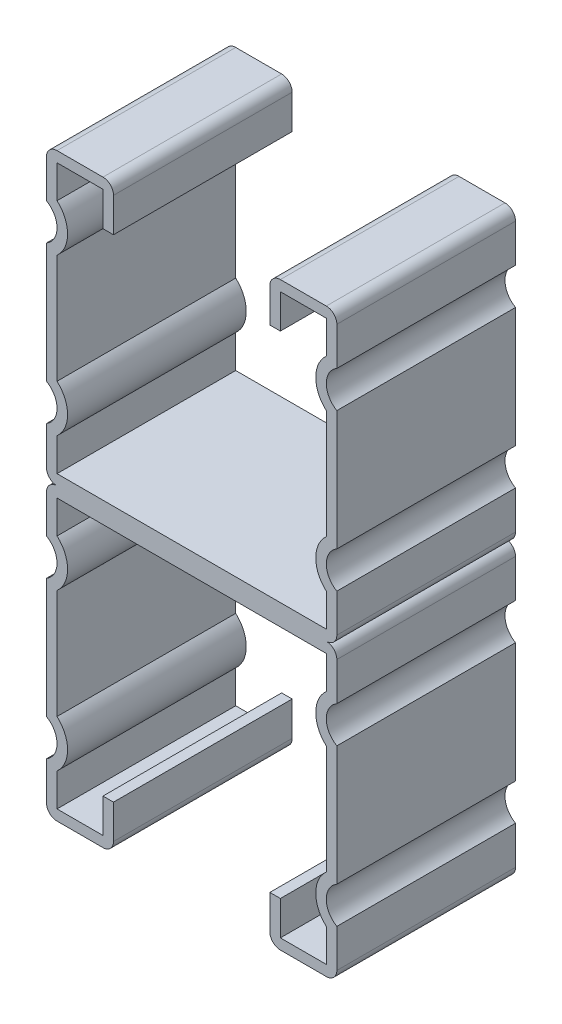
ISO-10303-21;
HEADER;
FILE_DESCRIPTION(('STEP AP214'),'2;1');
FILE_NAME('part.step','',(''),(''),'','','');
FILE_SCHEMA(('AUTOMOTIVE_DESIGN { 1 0 10303 214 1 1 1 1 }'));
ENDSEC;
DATA;
#1=APPLICATION_CONTEXT('core data for automotive mechanical design processes');
#2=APPLICATION_PROTOCOL_DEFINITION('international standard','automotive_design',2000,#1);
#3=PRODUCT_CONTEXT('',#1,'mechanical');
#4=PRODUCT('Part','Part','',(#3));
#5=PRODUCT_RELATED_PRODUCT_CATEGORY('part','',(#4));
#6=PRODUCT_DEFINITION_FORMATION('','',#4);
#7=PRODUCT_DEFINITION_CONTEXT('part definition',#1,'design');
#8=PRODUCT_DEFINITION('design','',#6,#7);
#9=PRODUCT_DEFINITION_SHAPE('','',#8);
#10=(LENGTH_UNIT() NAMED_UNIT(*) SI_UNIT(.MILLI.,.METRE.));
#11=(NAMED_UNIT(*) PLANE_ANGLE_UNIT() SI_UNIT($,.RADIAN.));
#12=(NAMED_UNIT(*) SI_UNIT($,.STERADIAN.) SOLID_ANGLE_UNIT());
#13=UNCERTAINTY_MEASURE_WITH_UNIT(LENGTH_MEASURE(1.E-05),#10,'distance_accuracy_value','');
#14=(GEOMETRIC_REPRESENTATION_CONTEXT(3) GLOBAL_UNCERTAINTY_ASSIGNED_CONTEXT((#13)) GLOBAL_UNIT_ASSIGNED_CONTEXT((#10,
#11,#12)) REPRESENTATION_CONTEXT('',''));
#15=CARTESIAN_POINT('',(0.,0.,0.));
#16=DIRECTION('',(0.,0.,1.));
#17=DIRECTION('',(1.,0.,0.));
#18=AXIS2_PLACEMENT_3D('',#15,#16,#17);
#19=CARTESIAN_POINT('',(-39.7764,39.7764,12.7));
#20=DIRECTION('',(-1.,0.,0.));
#21=DIRECTION('',(0.,0.,1.));
#22=AXIS2_PLACEMENT_3D('',#19,#20,#21);
#23=PLANE('',#22);
#24=DIRECTION('',(0.,1.,0.));
#25=VECTOR('',#24,1.);
#26=CARTESIAN_POINT('',(-39.7764,39.7764,-12.7));
#27=LINE('',#26,#25);
#28=CARTESIAN_POINT('',(-39.7764,35.1009714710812,-12.7));
#29=VERTEX_POINT('',#28);
#30=CARTESIAN_POINT('',(-39.7764,39.7764,-12.7));
#31=VERTEX_POINT('',#30);
#32=EDGE_CURVE('E327',#29,#31,#27,.T.);
#33=ORIENTED_EDGE('',*,*,#32,.T.);
#34=DIRECTION('',(0.,0.,-1.));
#35=VECTOR('',#34,1.);
#36=CARTESIAN_POINT('',(-39.7764,39.7764,12.7));
#37=LINE('',#36,#35);
#38=CARTESIAN_POINT('',(-39.7764,39.7764,12.7));
#39=VERTEX_POINT('',#38);
#40=EDGE_CURVE('E11',#39,#31,#37,.T.);
#41=ORIENTED_EDGE('',*,*,#40,.F.);
#42=DIRECTION('',(0.,1.,0.));
#43=VECTOR('',#42,1.);
#44=CARTESIAN_POINT('',(-39.7764,39.7764,12.7));
#45=LINE('',#44,#43);
#46=CARTESIAN_POINT('',(-39.7764,35.1009714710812,12.7));
#47=VERTEX_POINT('',#46);
#48=EDGE_CURVE('E434',#47,#39,#45,.T.);
#49=ORIENTED_EDGE('',*,*,#48,.F.);
#50=DIRECTION('',(0.,0.,-1.));
#51=VECTOR('',#50,1.);
#52=CARTESIAN_POINT('',(-39.7764,35.1009714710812,12.7));
#53=LINE('',#52,#51);
#54=EDGE_CURVE('E321',#47,#29,#53,.T.);
#55=ORIENTED_EDGE('',*,*,#54,.T.);
#56=EDGE_LOOP('',(#33,#41,#49,#55));
#57=FACE_BOUND('',#56,.T.);
#58=ADVANCED_FACE('F41',(#57),#23,.F.);
#59=CARTESIAN_POINT('',(-39.7764,39.7764,12.7));
#60=DIRECTION('',(0.,1.,0.));
#61=DIRECTION('',(-1.,0.,0.));
#62=AXIS2_PLACEMENT_3D('',#59,#60,#61);
#63=PLANE('',#62);
#64=DIRECTION('',(1.,0.,0.));
#65=VECTOR('',#64,1.);
#66=CARTESIAN_POINT('',(-39.7764,39.7764,-12.7));
#67=LINE('',#66,#65);
#68=CARTESIAN_POINT('',(-33.2486,39.7764,-12.7));
#69=VERTEX_POINT('',#68);
#70=EDGE_CURVE('E326',#31,#69,#67,.T.);
#71=ORIENTED_EDGE('',*,*,#70,.T.);
#72=DIRECTION('',(0.,0.,-1.));
#73=VECTOR('',#72,1.);
#74=CARTESIAN_POINT('',(-33.2486,39.7764,12.7));
#75=LINE('',#74,#73);
#76=CARTESIAN_POINT('',(-33.2486,39.7764,12.7));
#77=VERTEX_POINT('',#76);
#78=EDGE_CURVE('E49',#77,#69,#75,.T.);
#79=ORIENTED_EDGE('',*,*,#78,.F.);
#80=DIRECTION('',(1.,0.,0.));
#81=VECTOR('',#80,1.);
#82=CARTESIAN_POINT('',(-39.7764,39.7764,12.7));
#83=LINE('',#82,#81);
#84=EDGE_CURVE('E186',#39,#77,#83,.T.);
#85=ORIENTED_EDGE('',*,*,#84,.F.);
#86=ORIENTED_EDGE('',*,*,#40,.T.);
#87=EDGE_LOOP('',(#71,#79,#85,#86));
#88=FACE_BOUND('',#87,.T.);
#89=ADVANCED_FACE('F804',(#88),#63,.F.);
#90=CARTESIAN_POINT('',(-33.2486,39.7764,12.7));
#91=DIRECTION('',(1.,0.,0.));
#92=DIRECTION('',(0.,0.,-1.));
#93=AXIS2_PLACEMENT_3D('',#90,#91,#92);
#94=PLANE('',#93);
#95=DIRECTION('',(0.,-1.,0.));
#96=VECTOR('',#95,1.);
#97=CARTESIAN_POINT('',(-33.2486,39.7764,-12.7));
#98=LINE('',#97,#96);
#99=CARTESIAN_POINT('',(-33.2486,34.925,-12.7));
#100=VERTEX_POINT('',#99);
#101=EDGE_CURVE('E331',#69,#100,#98,.T.);
#102=ORIENTED_EDGE('',*,*,#101,.T.);
#103=DIRECTION('',(0.,0.,-1.));
#104=VECTOR('',#103,1.);
#105=CARTESIAN_POINT('',(-33.2486,34.925,12.7));
#106=LINE('',#105,#104);
#107=CARTESIAN_POINT('',(-33.2486,34.925,12.7));
#108=VERTEX_POINT('',#107);
#109=EDGE_CURVE('E564',#108,#100,#106,.T.);
#110=ORIENTED_EDGE('',*,*,#109,.F.);
#111=DIRECTION('',(0.,-1.,0.));
#112=VECTOR('',#111,1.);
#113=CARTESIAN_POINT('',(-33.2486,39.7764,12.7));
#114=LINE('',#113,#112);
#115=EDGE_CURVE('E580',#77,#108,#114,.T.);
#116=ORIENTED_EDGE('',*,*,#115,.F.);
#117=ORIENTED_EDGE('',*,*,#78,.T.);
#118=EDGE_LOOP('',(#102,#110,#116,#117));
#119=FACE_BOUND('',#118,.T.);
#120=ADVANCED_FACE('F574',(#119),#94,.F.);
#121=CARTESIAN_POINT('',(-33.2486,34.925,12.7));
#122=DIRECTION('',(0.,1.,0.));
#123=DIRECTION('',(0.,0.,1.));
#124=AXIS2_PLACEMENT_3D('',#121,#122,#123);
#125=PLANE('',#124);
#126=DIRECTION('',(1.,0.,0.));
#127=VECTOR('',#126,1.);
#128=CARTESIAN_POINT('',(-33.2486,34.925,-12.7));
#129=LINE('',#128,#127);
#130=CARTESIAN_POINT('',(-31.75,34.925,-12.7));
#131=VERTEX_POINT('',#130);
#132=EDGE_CURVE('E340',#100,#131,#129,.T.);
#133=ORIENTED_EDGE('',*,*,#132,.T.);
#134=DIRECTION('',(0.,0.,-1.));
#135=VECTOR('',#134,1.);
#136=CARTESIAN_POINT('',(-31.75,34.925,12.7));
#137=LINE('',#136,#135);
#138=CARTESIAN_POINT('',(-31.75,34.925,12.7));
#139=VERTEX_POINT('',#138);
#140=EDGE_CURVE('E561',#139,#131,#137,.T.);
#141=ORIENTED_EDGE('',*,*,#140,.F.);
#142=DIRECTION('',(1.,0.,0.));
#143=VECTOR('',#142,1.);
#144=CARTESIAN_POINT('',(-33.2486,34.925,12.7));
#145=LINE('',#144,#143);
#146=EDGE_CURVE('E597',#108,#139,#145,.T.);
#147=ORIENTED_EDGE('',*,*,#146,.F.);
#148=ORIENTED_EDGE('',*,*,#109,.T.);
#149=EDGE_LOOP('',(#133,#141,#147,#148));
#150=FACE_BOUND('',#149,.T.);
#151=ADVANCED_FACE('F587',(#150),#125,.F.);
#152=CARTESIAN_POINT('',(-31.75,39.7764,12.7));
#153=DIRECTION('',(-1.,0.,0.));
#154=DIRECTION('',(0.,0.,1.));
#155=AXIS2_PLACEMENT_3D('',#152,#153,#154);
#156=PLANE('',#155);
#157=DIRECTION('',(0.,1.,0.));
#158=VECTOR('',#157,1.);
#159=CARTESIAN_POINT('',(-31.75,39.7764,-12.7));
#160=LINE('',#159,#158);
#161=CARTESIAN_POINT('',(-31.75,39.7764,-12.7));
#162=VERTEX_POINT('',#161);
#163=EDGE_CURVE('E338',#131,#162,#160,.T.);
#164=ORIENTED_EDGE('',*,*,#163,.T.);
#165=DIRECTION('',(0.,0.,-1.));
#166=VECTOR('',#165,1.);
#167=CARTESIAN_POINT('',(-31.75,39.7764,12.7));
#168=LINE('',#167,#166);
#169=CARTESIAN_POINT('',(-31.75,39.7764,12.7));
#170=VERTEX_POINT('',#169);
#171=EDGE_CURVE('E560',#170,#162,#168,.T.);
#172=ORIENTED_EDGE('',*,*,#171,.F.);
#173=DIRECTION('',(0.,1.,0.));
#174=VECTOR('',#173,1.);
#175=CARTESIAN_POINT('',(-31.75,39.7764,12.7));
#176=LINE('',#175,#174);
#177=EDGE_CURVE('E595',#139,#170,#176,.T.);
#178=ORIENTED_EDGE('',*,*,#177,.F.);
#179=ORIENTED_EDGE('',*,*,#140,.T.);
#180=EDGE_LOOP('',(#164,#172,#178,#179));
#181=FACE_BOUND('',#180,.T.);
#182=ADVANCED_FACE('F586',(#181),#156,.F.);
#183=CARTESIAN_POINT('',(-33.2486,39.7764,12.7));
#184=DIRECTION('',(0.,0.,-1.));
#185=DIRECTION('',(-1.,0.,0.));
#186=AXIS2_PLACEMENT_3D('',#183,#184,#185);
#187=CYLINDRICAL_SURFACE('',#186,1.4986);
#188=CARTESIAN_POINT('',(-33.2486,39.7764,-12.7));
#189=DIRECTION('',(0.,0.,1.));
#190=DIRECTION('',(-1.,0.,0.));
#191=AXIS2_PLACEMENT_3D('',#188,#189,#190);
#192=CIRCLE('',#191,1.4986);
#193=CARTESIAN_POINT('',(-33.2486,41.275,-12.7));
#194=VERTEX_POINT('',#193);
#195=EDGE_CURVE('E345',#162,#194,#192,.T.);
#196=ORIENTED_EDGE('',*,*,#195,.T.);
#197=DIRECTION('',(0.,0.,-1.));
#198=VECTOR('',#197,1.);
#199=CARTESIAN_POINT('',(-33.2486,41.275,12.7));
#200=LINE('',#199,#198);
#201=CARTESIAN_POINT('',(-33.2486,41.275,12.7));
#202=VERTEX_POINT('',#201);
#203=EDGE_CURVE('E551',#202,#194,#200,.T.);
#204=ORIENTED_EDGE('',*,*,#203,.F.);
#205=CARTESIAN_POINT('',(-33.2486,39.7764,12.7));
#206=DIRECTION('',(0.,0.,1.));
#207=DIRECTION('',(-1.,0.,0.));
#208=AXIS2_PLACEMENT_3D('',#205,#206,#207);
#209=CIRCLE('',#208,1.4986);
#210=EDGE_CURVE('E593',#170,#202,#209,.T.);
#211=ORIENTED_EDGE('',*,*,#210,.F.);
#212=ORIENTED_EDGE('',*,*,#171,.T.);
#213=EDGE_LOOP('',(#196,#204,#211,#212));
#214=FACE_BOUND('',#213,.T.);
#215=ADVANCED_FACE('F820',(#214),#187,.T.);
#216=CARTESIAN_POINT('',(-39.7764,41.275,12.7));
#217=DIRECTION('',(0.,-1.,0.));
#218=DIRECTION('',(0.,0.,-1.));
#219=AXIS2_PLACEMENT_3D('',#216,#217,#218);
#220=PLANE('',#219);
#221=DIRECTION('',(-1.,0.,0.));
#222=VECTOR('',#221,1.);
#223=CARTESIAN_POINT('',(-39.7764,41.275,-12.7));
#224=LINE('',#223,#222);
#225=CARTESIAN_POINT('',(-39.7764,41.275,-12.7));
#226=VERTEX_POINT('',#225);
#227=EDGE_CURVE('E347',#194,#226,#224,.T.);
#228=ORIENTED_EDGE('',*,*,#227,.T.);
#229=DIRECTION('',(0.,0.,-1.));
#230=VECTOR('',#229,1.);
#231=CARTESIAN_POINT('',(-39.7764,41.275,12.7));
#232=LINE('',#231,#230);
#233=CARTESIAN_POINT('',(-39.7764,41.275,12.7));
#234=VERTEX_POINT('',#233);
#235=EDGE_CURVE('E546',#234,#226,#232,.T.);
#236=ORIENTED_EDGE('',*,*,#235,.F.);
#237=DIRECTION('',(-1.,0.,0.));
#238=VECTOR('',#237,1.);
#239=CARTESIAN_POINT('',(-39.7764,41.275,12.7));
#240=LINE('',#239,#238);
#241=EDGE_CURVE('E598',#202,#234,#240,.T.);
#242=ORIENTED_EDGE('',*,*,#241,.F.);
#243=ORIENTED_EDGE('',*,*,#203,.T.);
#244=EDGE_LOOP('',(#228,#236,#242,#243));
#245=FACE_BOUND('',#244,.T.);
#246=ADVANCED_FACE('F817',(#245),#220,.F.);
#247=CARTESIAN_POINT('',(-39.7764,39.7764,12.7));
#248=DIRECTION('',(0.,0.,-1.));
#249=DIRECTION('',(-1.,0.,0.));
#250=AXIS2_PLACEMENT_3D('',#247,#248,#249);
#251=CYLINDRICAL_SURFACE('',#250,1.49860000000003);
#252=CARTESIAN_POINT('',(-39.7764,39.7764,-12.7));
#253=DIRECTION('',(0.,0.,1.));
#254=DIRECTION('',(-1.,0.,0.));
#255=AXIS2_PLACEMENT_3D('',#252,#253,#254);
#256=CIRCLE('',#255,1.49860000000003);
#257=CARTESIAN_POINT('',(-41.275,39.7764,-12.7));
#258=VERTEX_POINT('',#257);
#259=EDGE_CURVE('E349',#226,#258,#256,.T.);
#260=ORIENTED_EDGE('',*,*,#259,.T.);
#261=DIRECTION('',(0.,0.,-1.));
#262=VECTOR('',#261,1.);
#263=CARTESIAN_POINT('',(-41.275,39.7764,12.7));
#264=LINE('',#263,#262);
#265=CARTESIAN_POINT('',(-41.275,39.7764,12.7));
#266=VERTEX_POINT('',#265);
#267=EDGE_CURVE('E541',#266,#258,#264,.T.);
#268=ORIENTED_EDGE('',*,*,#267,.F.);
#269=CARTESIAN_POINT('',(-39.7764,39.7764,12.7));
#270=DIRECTION('',(0.,0.,1.));
#271=DIRECTION('',(-1.,0.,0.));
#272=AXIS2_PLACEMENT_3D('',#269,#270,#271);
#273=CIRCLE('',#272,1.49860000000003);
#274=EDGE_CURVE('E608',#234,#266,#273,.T.);
#275=ORIENTED_EDGE('',*,*,#274,.F.);
#276=ORIENTED_EDGE('',*,*,#235,.T.);
#277=EDGE_LOOP('',(#260,#268,#275,#276));
#278=FACE_BOUND('',#277,.T.);
#279=ADVANCED_FACE('F822',(#278),#251,.T.);
#280=CARTESIAN_POINT('',(-41.275,39.7764,12.7));
#281=DIRECTION('',(1.,0.,0.));
#282=DIRECTION('',(0.,0.,-1.));
#283=AXIS2_PLACEMENT_3D('',#280,#281,#282);
#284=PLANE('',#283);
#285=DIRECTION('',(0.,-1.,0.));
#286=VECTOR('',#285,1.);
#287=CARTESIAN_POINT('',(-41.275,39.7764,-12.7));
#288=LINE('',#287,#286);
#289=CARTESIAN_POINT('',(-41.275,34.3456513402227,-12.7));
#290=VERTEX_POINT('',#289);
#291=EDGE_CURVE('E355',#258,#290,#288,.T.);
#292=ORIENTED_EDGE('',*,*,#291,.T.);
#293=DIRECTION('',(0.,0.,-1.));
#294=VECTOR('',#293,1.);
#295=CARTESIAN_POINT('',(-41.275,34.3456513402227,12.7));
#296=LINE('',#295,#294);
#297=CARTESIAN_POINT('',(-41.275,34.3456513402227,12.7));
#298=VERTEX_POINT('',#297);
#299=EDGE_CURVE('E542',#298,#290,#296,.T.);
#300=ORIENTED_EDGE('',*,*,#299,.F.);
#301=DIRECTION('',(0.,-1.,0.));
#302=VECTOR('',#301,1.);
#303=CARTESIAN_POINT('',(-41.275,39.7764,12.7));
#304=LINE('',#303,#302);
#305=EDGE_CURVE('E612',#266,#298,#304,.T.);
#306=ORIENTED_EDGE('',*,*,#305,.F.);
#307=ORIENTED_EDGE('',*,*,#267,.T.);
#308=EDGE_LOOP('',(#292,#300,#306,#307));
#309=FACE_BOUND('',#308,.T.);
#310=ADVANCED_FACE('F828',(#309),#284,.F.);
#311=CARTESIAN_POINT('',(-42.7736,31.75,12.7));
#312=DIRECTION('',(0.,0.,-1.));
#313=DIRECTION('',(-1.,0.,0.));
#314=AXIS2_PLACEMENT_3D('',#311,#312,#313);
#315=CYLINDRICAL_SURFACE('',#314,2.9972);
#316=CARTESIAN_POINT('',(-42.7736,31.75,-12.7));
#317=DIRECTION('',(0.,0.,-1.));
#318=DIRECTION('',(1.,0.,0.));
#319=AXIS2_PLACEMENT_3D('',#316,#317,#318);
#320=CIRCLE('',#319,2.9972);
#321=CARTESIAN_POINT('',(-41.275,29.1543486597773,-12.7));
#322=VERTEX_POINT('',#321);
#323=EDGE_CURVE('E353',#290,#322,#320,.T.);
#324=ORIENTED_EDGE('',*,*,#323,.T.);
#325=DIRECTION('',(0.,0.,-1.));
#326=VECTOR('',#325,1.);
#327=CARTESIAN_POINT('',(-41.275,29.1543486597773,12.7));
#328=LINE('',#327,#326);
#329=CARTESIAN_POINT('',(-41.275,29.1543486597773,12.7));
#330=VERTEX_POINT('',#329);
#331=EDGE_CURVE('E536',#330,#322,#328,.T.);
#332=ORIENTED_EDGE('',*,*,#331,.F.);
#333=CARTESIAN_POINT('',(-42.7736,31.75,12.7));
#334=DIRECTION('',(0.,0.,-1.));
#335=DIRECTION('',(1.,0.,0.));
#336=AXIS2_PLACEMENT_3D('',#333,#334,#335);
#337=CIRCLE('',#336,2.9972);
#338=EDGE_CURVE('E611',#298,#330,#337,.T.);
#339=ORIENTED_EDGE('',*,*,#338,.F.);
#340=ORIENTED_EDGE('',*,*,#299,.T.);
#341=EDGE_LOOP('',(#324,#332,#339,#340));
#342=FACE_BOUND('',#341,.T.);
#343=ADVANCED_FACE('F835',(#342),#315,.F.);
#344=CARTESIAN_POINT('',(-41.275,29.1543486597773,12.7));
#345=DIRECTION('',(1.,0.,0.));
#346=DIRECTION('',(0.,0.,-1.));
#347=AXIS2_PLACEMENT_3D('',#344,#345,#346);
#348=PLANE('',#347);
#349=DIRECTION('',(0.,-1.,0.));
#350=VECTOR('',#349,1.);
#351=CARTESIAN_POINT('',(-41.275,29.1543486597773,-12.7));
#352=LINE('',#351,#350);
#353=CARTESIAN_POINT('',(-41.275,12.1206513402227,-12.7));
#354=VERTEX_POINT('',#353);
#355=EDGE_CURVE('E356',#322,#354,#352,.T.);
#356=ORIENTED_EDGE('',*,*,#355,.T.);
#357=DIRECTION('',(0.,0.,-1.));
#358=VECTOR('',#357,1.);
#359=CARTESIAN_POINT('',(-41.275,12.1206513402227,12.7));
#360=LINE('',#359,#358);
#361=CARTESIAN_POINT('',(-41.275,12.1206513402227,12.7));
#362=VERTEX_POINT('',#361);
#363=EDGE_CURVE('E531',#362,#354,#360,.T.);
#364=ORIENTED_EDGE('',*,*,#363,.F.);
#365=DIRECTION('',(0.,-1.,0.));
#366=VECTOR('',#365,1.);
#367=CARTESIAN_POINT('',(-41.275,29.1543486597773,12.7));
#368=LINE('',#367,#366);
#369=EDGE_CURVE('E617',#330,#362,#368,.T.);
#370=ORIENTED_EDGE('',*,*,#369,.F.);
#371=ORIENTED_EDGE('',*,*,#331,.T.);
#372=EDGE_LOOP('',(#356,#364,#370,#371));
#373=FACE_BOUND('',#372,.T.);
#374=ADVANCED_FACE('F837',(#373),#348,.F.);
#375=CARTESIAN_POINT('',(-42.7736,9.525,12.7));
#376=DIRECTION('',(0.,0.,-1.));
#377=DIRECTION('',(-1.,0.,0.));
#378=AXIS2_PLACEMENT_3D('',#375,#376,#377);
#379=CYLINDRICAL_SURFACE('',#378,2.9972);
#380=CARTESIAN_POINT('',(-42.7736,9.525,-12.7));
#381=DIRECTION('',(0.,0.,-1.));
#382=DIRECTION('',(-1.,0.,0.));
#383=AXIS2_PLACEMENT_3D('',#380,#381,#382);
#384=CIRCLE('',#383,2.9972);
#385=CARTESIAN_POINT('',(-41.275,6.92934865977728,-12.7));
#386=VERTEX_POINT('',#385);
#387=EDGE_CURVE('E363',#354,#386,#384,.T.);
#388=ORIENTED_EDGE('',*,*,#387,.T.);
#389=DIRECTION('',(0.,0.,-1.));
#390=VECTOR('',#389,1.);
#391=CARTESIAN_POINT('',(-41.275,6.92934865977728,12.7));
#392=LINE('',#391,#390);
#393=CARTESIAN_POINT('',(-41.275,6.92934865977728,12.7));
#394=VERTEX_POINT('',#393);
#395=EDGE_CURVE('E526',#394,#386,#392,.T.);
#396=ORIENTED_EDGE('',*,*,#395,.F.);
#397=CARTESIAN_POINT('',(-42.7736,9.525,12.7));
#398=DIRECTION('',(0.,0.,-1.));
#399=DIRECTION('',(-1.,0.,0.));
#400=AXIS2_PLACEMENT_3D('',#397,#398,#399);
#401=CIRCLE('',#400,2.9972);
#402=EDGE_CURVE('E619',#362,#394,#401,.T.);
#403=ORIENTED_EDGE('',*,*,#402,.F.);
#404=ORIENTED_EDGE('',*,*,#363,.T.);
#405=EDGE_LOOP('',(#388,#396,#403,#404));
#406=FACE_BOUND('',#405,.T.);
#407=ADVANCED_FACE('F838',(#406),#379,.F.);
#408=CARTESIAN_POINT('',(-41.275,6.92934865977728,12.7));
#409=DIRECTION('',(1.,0.,0.));
#410=DIRECTION('',(0.,1.,0.));
#411=AXIS2_PLACEMENT_3D('',#408,#409,#410);
#412=PLANE('',#411);
#413=DIRECTION('',(0.,-1.,0.));
#414=VECTOR('',#413,1.);
#415=CARTESIAN_POINT('',(-41.275,6.92934865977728,-12.7));
#416=LINE('',#415,#414);
#417=CARTESIAN_POINT('',(-41.275,1.4986,-12.7));
#418=VERTEX_POINT('',#417);
#419=EDGE_CURVE('E364',#386,#418,#416,.T.);
#420=ORIENTED_EDGE('',*,*,#419,.T.);
#421=DIRECTION('',(0.,0.,-1.));
#422=VECTOR('',#421,1.);
#423=CARTESIAN_POINT('',(-41.275,1.4986,12.7));
#424=LINE('',#423,#422);
#425=CARTESIAN_POINT('',(-41.275,1.4986,12.7));
#426=VERTEX_POINT('',#425);
#427=EDGE_CURVE('E521',#426,#418,#424,.T.);
#428=ORIENTED_EDGE('',*,*,#427,.F.);
#429=DIRECTION('',(0.,-1.,0.));
#430=VECTOR('',#429,1.);
#431=CARTESIAN_POINT('',(-41.275,6.92934865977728,12.7));
#432=LINE('',#431,#430);
#433=EDGE_CURVE('E621',#394,#426,#432,.T.);
#434=ORIENTED_EDGE('',*,*,#433,.F.);
#435=ORIENTED_EDGE('',*,*,#395,.T.);
#436=EDGE_LOOP('',(#420,#428,#434,#435));
#437=FACE_BOUND('',#436,.T.);
#438=ADVANCED_FACE('F843',(#437),#412,.F.);
#439=CARTESIAN_POINT('',(-39.7764,1.4986,12.7));
#440=DIRECTION('',(0.,0.,-1.));
#441=DIRECTION('',(-1.,0.,0.));
#442=AXIS2_PLACEMENT_3D('',#439,#440,#441);
#443=CYLINDRICAL_SURFACE('',#442,1.4986);
#444=CARTESIAN_POINT('',(-39.7764,1.4986,-12.7));
#445=DIRECTION('',(0.,0.,1.));
#446=DIRECTION('',(-1.,0.,0.));
#447=AXIS2_PLACEMENT_3D('',#444,#445,#446);
#448=CIRCLE('',#447,1.4986);
#449=CARTESIAN_POINT('',(-39.7764,0.,-12.7));
#450=VERTEX_POINT('',#449);
#451=EDGE_CURVE('E370',#418,#450,#448,.T.);
#452=ORIENTED_EDGE('',*,*,#451,.T.);
#453=DIRECTION('',(0.,0.,-1.));
#454=VECTOR('',#453,1.);
#455=CARTESIAN_POINT('',(-39.7764,0.,12.7));
#456=LINE('',#455,#454);
#457=CARTESIAN_POINT('',(-39.7764,0.,12.7));
#458=VERTEX_POINT('',#457);
#459=EDGE_CURVE('E522',#458,#450,#456,.T.);
#460=ORIENTED_EDGE('',*,*,#459,.F.);
#461=CARTESIAN_POINT('',(-39.7764,1.4986,12.7));
#462=DIRECTION('',(0.,0.,1.));
#463=DIRECTION('',(-1.,0.,0.));
#464=AXIS2_PLACEMENT_3D('',#461,#462,#463);
#465=CIRCLE('',#464,1.4986);
#466=EDGE_CURVE('E626',#426,#458,#465,.T.);
#467=ORIENTED_EDGE('',*,*,#466,.F.);
#468=ORIENTED_EDGE('',*,*,#427,.T.);
#469=EDGE_LOOP('',(#452,#460,#467,#468));
#470=FACE_BOUND('',#469,.T.);
#471=ADVANCED_FACE('F848',(#470),#443,.T.);
#472=CARTESIAN_POINT('',(-1.49860000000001,1.4986,12.7));
#473=DIRECTION('',(0.,0.,-1.));
#474=DIRECTION('',(-1.,0.,0.));
#475=AXIS2_PLACEMENT_3D('',#472,#473,#474);
#476=CYLINDRICAL_SURFACE('',#475,1.4986);
#477=CARTESIAN_POINT('',(-1.49860000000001,1.4986,-12.7));
#478=DIRECTION('',(0.,0.,1.));
#479=DIRECTION('',(-1.,0.,0.));
#480=AXIS2_PLACEMENT_3D('',#477,#478,#479);
#481=CIRCLE('',#480,1.4986);
#482=CARTESIAN_POINT('',(-1.49860000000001,0.,-12.7));
#483=VERTEX_POINT('',#482);
#484=CARTESIAN_POINT('',(0.,1.4986,-12.7));
#485=VERTEX_POINT('',#484);
#486=EDGE_CURVE('E369',#483,#485,#481,.T.);
#487=ORIENTED_EDGE('',*,*,#486,.T.);
#488=DIRECTION('',(0.,0.,-1.));
#489=VECTOR('',#488,1.);
#490=CARTESIAN_POINT('',(0.,1.4986,12.7));
#491=LINE('',#490,#489);
#492=CARTESIAN_POINT('',(0.,1.4986,12.7));
#493=VERTEX_POINT('',#492);
#494=EDGE_CURVE('E514',#493,#485,#491,.T.);
#495=ORIENTED_EDGE('',*,*,#494,.F.);
#496=CARTESIAN_POINT('',(-1.49860000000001,1.4986,12.7));
#497=DIRECTION('',(0.,0.,1.));
#498=DIRECTION('',(-1.,0.,0.));
#499=AXIS2_PLACEMENT_3D('',#496,#497,#498);
#500=CIRCLE('',#499,1.4986);
#501=CARTESIAN_POINT('',(-1.49860000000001,0.,12.7));
#502=VERTEX_POINT('',#501);
#503=EDGE_CURVE('E627',#502,#493,#500,.T.);
#504=ORIENTED_EDGE('',*,*,#503,.F.);
#505=DIRECTION('',(0.,0.,-1.));
#506=VECTOR('',#505,1.);
#507=CARTESIAN_POINT('',(-1.49860000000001,0.,12.7));
#508=LINE('',#507,#506);
#509=EDGE_CURVE('E516',#502,#483,#508,.T.);
#510=ORIENTED_EDGE('',*,*,#509,.T.);
#511=EDGE_LOOP('',(#487,#495,#504,#510));
#512=FACE_BOUND('',#511,.T.);
#513=ADVANCED_FACE('F852',(#512),#476,.T.);
#514=CARTESIAN_POINT('',(0.,1.4986,12.7));
#515=DIRECTION('',(-1.,0.,0.));
#516=DIRECTION('',(0.,0.,1.));
#517=AXIS2_PLACEMENT_3D('',#514,#515,#516);
#518=PLANE('',#517);
#519=DIRECTION('',(0.,1.,0.));
#520=VECTOR('',#519,1.);
#521=CARTESIAN_POINT('',(0.,1.4986,-12.7));
#522=LINE('',#521,#520);
#523=CARTESIAN_POINT('',(0.,6.92934865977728,-12.7));
#524=VERTEX_POINT('',#523);
#525=EDGE_CURVE('E373',#485,#524,#522,.T.);
#526=ORIENTED_EDGE('',*,*,#525,.T.);
#527=DIRECTION('',(0.,0.,-1.));
#528=VECTOR('',#527,1.);
#529=CARTESIAN_POINT('',(0.,6.92934865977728,12.7));
#530=LINE('',#529,#528);
#531=CARTESIAN_POINT('',(0.,6.92934865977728,12.7));
#532=VERTEX_POINT('',#531);
#533=EDGE_CURVE('E508',#532,#524,#530,.T.);
#534=ORIENTED_EDGE('',*,*,#533,.F.);
#535=DIRECTION('',(0.,1.,0.));
#536=VECTOR('',#535,1.);
#537=CARTESIAN_POINT('',(0.,1.4986,12.7));
#538=LINE('',#537,#536);
#539=EDGE_CURVE('E635',#493,#532,#538,.T.);
#540=ORIENTED_EDGE('',*,*,#539,.F.);
#541=ORIENTED_EDGE('',*,*,#494,.T.);
#542=EDGE_LOOP('',(#526,#534,#540,#541));
#543=FACE_BOUND('',#542,.T.);
#544=ADVANCED_FACE('F853',(#543),#518,.F.);
#545=CARTESIAN_POINT('',(1.49859999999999,9.525,12.7));
#546=DIRECTION('',(0.,0.,-1.));
#547=DIRECTION('',(-1.,0.,0.));
#548=AXIS2_PLACEMENT_3D('',#545,#546,#547);
#549=CYLINDRICAL_SURFACE('',#548,2.9972);
#550=CARTESIAN_POINT('',(1.49859999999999,9.525,-12.7));
#551=DIRECTION('',(0.,0.,-1.));
#552=DIRECTION('',(-1.,0.,0.));
#553=AXIS2_PLACEMENT_3D('',#550,#551,#552);
#554=CIRCLE('',#553,2.9972);
#555=CARTESIAN_POINT('',(0.,12.1206513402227,-12.7));
#556=VERTEX_POINT('',#555);
#557=EDGE_CURVE('E376',#524,#556,#554,.T.);
#558=ORIENTED_EDGE('',*,*,#557,.T.);
#559=DIRECTION('',(0.,0.,-1.));
#560=VECTOR('',#559,1.);
#561=CARTESIAN_POINT('',(0.,12.1206513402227,12.7));
#562=LINE('',#561,#560);
#563=CARTESIAN_POINT('',(0.,12.1206513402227,12.7));
#564=VERTEX_POINT('',#563);
#565=EDGE_CURVE('E504',#564,#556,#562,.T.);
#566=ORIENTED_EDGE('',*,*,#565,.F.);
#567=CARTESIAN_POINT('',(1.49859999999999,9.525,12.7));
#568=DIRECTION('',(0.,0.,-1.));
#569=DIRECTION('',(-1.,0.,0.));
#570=AXIS2_PLACEMENT_3D('',#567,#568,#569);
#571=CIRCLE('',#570,2.9972);
#572=EDGE_CURVE('E634',#532,#564,#571,.T.);
#573=ORIENTED_EDGE('',*,*,#572,.F.);
#574=ORIENTED_EDGE('',*,*,#533,.T.);
#575=EDGE_LOOP('',(#558,#566,#573,#574));
#576=FACE_BOUND('',#575,.T.);
#577=ADVANCED_FACE('F859',(#576),#549,.F.);
#578=CARTESIAN_POINT('',(0.,12.1206513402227,12.7));
#579=DIRECTION('',(-1.,0.,0.));
#580=DIRECTION('',(0.,-1.,0.));
#581=AXIS2_PLACEMENT_3D('',#578,#579,#580);
#582=PLANE('',#581);
#583=DIRECTION('',(0.,1.,0.));
#584=VECTOR('',#583,1.);
#585=CARTESIAN_POINT('',(0.,12.1206513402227,-12.7));
#586=LINE('',#585,#584);
#587=CARTESIAN_POINT('',(0.,29.1543486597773,-12.7));
#588=VERTEX_POINT('',#587);
#589=EDGE_CURVE('E378',#556,#588,#586,.T.);
#590=ORIENTED_EDGE('',*,*,#589,.T.);
#591=DIRECTION('',(0.,0.,-1.));
#592=VECTOR('',#591,1.);
#593=CARTESIAN_POINT('',(0.,29.1543486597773,12.7));
#594=LINE('',#593,#592);
#595=CARTESIAN_POINT('',(0.,29.1543486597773,12.7));
#596=VERTEX_POINT('',#595);
#597=EDGE_CURVE('E501',#596,#588,#594,.T.);
#598=ORIENTED_EDGE('',*,*,#597,.F.);
#599=DIRECTION('',(0.,1.,0.));
#600=VECTOR('',#599,1.);
#601=CARTESIAN_POINT('',(0.,12.1206513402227,12.7));
#602=LINE('',#601,#600);
#603=EDGE_CURVE('E637',#564,#596,#602,.T.);
#604=ORIENTED_EDGE('',*,*,#603,.F.);
#605=ORIENTED_EDGE('',*,*,#565,.T.);
#606=EDGE_LOOP('',(#590,#598,#604,#605));
#607=FACE_BOUND('',#606,.T.);
#608=ADVANCED_FACE('F865',(#607),#582,.F.);
#609=CARTESIAN_POINT('',(1.49859999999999,31.75,12.7));
#610=DIRECTION('',(0.,0.,-1.));
#611=DIRECTION('',(-1.,0.,0.));
#612=AXIS2_PLACEMENT_3D('',#609,#610,#611);
#613=CYLINDRICAL_SURFACE('',#612,2.9972);
#614=CARTESIAN_POINT('',(1.49859999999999,31.75,-12.7));
#615=DIRECTION('',(0.,0.,-1.));
#616=DIRECTION('',(1.,0.,0.));
#617=AXIS2_PLACEMENT_3D('',#614,#615,#616);
#618=CIRCLE('',#617,2.9972);
#619=CARTESIAN_POINT('',(0.,34.3456513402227,-12.7));
#620=VERTEX_POINT('',#619);
#621=EDGE_CURVE('E385',#588,#620,#618,.T.);
#622=ORIENTED_EDGE('',*,*,#621,.T.);
#623=DIRECTION('',(0.,0.,-1.));
#624=VECTOR('',#623,1.);
#625=CARTESIAN_POINT('',(0.,34.3456513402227,12.7));
#626=LINE('',#625,#624);
#627=CARTESIAN_POINT('',(0.,34.3456513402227,12.7));
#628=VERTEX_POINT('',#627);
#629=EDGE_CURVE('E500',#628,#620,#626,.T.);
#630=ORIENTED_EDGE('',*,*,#629,.F.);
#631=CARTESIAN_POINT('',(1.49859999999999,31.75,12.7));
#632=DIRECTION('',(0.,0.,-1.));
#633=DIRECTION('',(1.,0.,0.));
#634=AXIS2_PLACEMENT_3D('',#631,#632,#633);
#635=CIRCLE('',#634,2.9972);
#636=EDGE_CURVE('E642',#596,#628,#635,.T.);
#637=ORIENTED_EDGE('',*,*,#636,.F.);
#638=ORIENTED_EDGE('',*,*,#597,.T.);
#639=EDGE_LOOP('',(#622,#630,#637,#638));
#640=FACE_BOUND('',#639,.T.);
#641=ADVANCED_FACE('F870',(#640),#613,.F.);
#642=CARTESIAN_POINT('',(0.,34.3456513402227,12.7));
#643=DIRECTION('',(-1.,0.,0.));
#644=DIRECTION('',(0.,-1.,0.));
#645=AXIS2_PLACEMENT_3D('',#642,#643,#644);
#646=PLANE('',#645);
#647=DIRECTION('',(0.,1.,0.));
#648=VECTOR('',#647,1.);
#649=CARTESIAN_POINT('',(0.,34.3456513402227,-12.7));
#650=LINE('',#649,#648);
#651=CARTESIAN_POINT('',(0.,39.7764,-12.7));
#652=VERTEX_POINT('',#651);
#653=EDGE_CURVE('E383',#620,#652,#650,.T.);
#654=ORIENTED_EDGE('',*,*,#653,.T.);
#655=DIRECTION('',(0.,0.,-1.));
#656=VECTOR('',#655,1.);
#657=CARTESIAN_POINT('',(0.,39.7764,12.7));
#658=LINE('',#657,#656);
#659=CARTESIAN_POINT('',(0.,39.7764,12.7));
#660=VERTEX_POINT('',#659);
#661=EDGE_CURVE('E491',#660,#652,#658,.T.);
#662=ORIENTED_EDGE('',*,*,#661,.F.);
#663=DIRECTION('',(0.,1.,0.));
#664=VECTOR('',#663,1.);
#665=CARTESIAN_POINT('',(0.,34.3456513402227,12.7));
#666=LINE('',#665,#664);
#667=EDGE_CURVE('E641',#628,#660,#666,.T.);
#668=ORIENTED_EDGE('',*,*,#667,.F.);
#669=ORIENTED_EDGE('',*,*,#629,.T.);
#670=EDGE_LOOP('',(#654,#662,#668,#669));
#671=FACE_BOUND('',#670,.T.);
#672=ADVANCED_FACE('F872',(#671),#646,.F.);
#673=CARTESIAN_POINT('',(-1.49860000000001,39.7764,12.7));
#674=DIRECTION('',(0.,0.,-1.));
#675=DIRECTION('',(-1.,0.,0.));
#676=AXIS2_PLACEMENT_3D('',#673,#674,#675);
#677=CYLINDRICAL_SURFACE('',#676,1.4986);
#678=CARTESIAN_POINT('',(-1.49860000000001,39.7764,-12.7));
#679=DIRECTION('',(0.,0.,1.));
#680=DIRECTION('',(-1.,0.,0.));
#681=AXIS2_PLACEMENT_3D('',#678,#679,#680);
#682=CIRCLE('',#681,1.4986);
#683=CARTESIAN_POINT('',(-1.49860000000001,41.275,-12.7));
#684=VERTEX_POINT('',#683);
#685=EDGE_CURVE('E390',#652,#684,#682,.T.);
#686=ORIENTED_EDGE('',*,*,#685,.T.);
#687=DIRECTION('',(0.,0.,-1.));
#688=VECTOR('',#687,1.);
#689=CARTESIAN_POINT('',(-1.49860000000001,41.275,12.7));
#690=LINE('',#689,#688);
#691=CARTESIAN_POINT('',(-1.49860000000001,41.275,12.7));
#692=VERTEX_POINT('',#691);
#693=EDGE_CURVE('E490',#692,#684,#690,.T.);
#694=ORIENTED_EDGE('',*,*,#693,.F.);
#695=CARTESIAN_POINT('',(-1.49860000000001,39.7764,12.7));
#696=DIRECTION('',(0.,0.,1.));
#697=DIRECTION('',(-1.,0.,0.));
#698=AXIS2_PLACEMENT_3D('',#695,#696,#697);
#699=CIRCLE('',#698,1.4986);
#700=EDGE_CURVE('E646',#660,#692,#699,.T.);
#701=ORIENTED_EDGE('',*,*,#700,.F.);
#702=ORIENTED_EDGE('',*,*,#661,.T.);
#703=EDGE_LOOP('',(#686,#694,#701,#702));
#704=FACE_BOUND('',#703,.T.);
#705=ADVANCED_FACE('F873',(#704),#677,.T.);
#706=CARTESIAN_POINT('',(-1.49860000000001,41.275,12.7));
#707=DIRECTION('',(0.,-1.,0.));
#708=DIRECTION('',(1.,0.,0.));
#709=AXIS2_PLACEMENT_3D('',#706,#707,#708);
#710=PLANE('',#709);
#711=DIRECTION('',(-1.,0.,0.));
#712=VECTOR('',#711,1.);
#713=CARTESIAN_POINT('',(-1.49860000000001,41.275,-12.7));
#714=LINE('',#713,#712);
#715=CARTESIAN_POINT('',(-8.0264,41.275,-12.7));
#716=VERTEX_POINT('',#715);
#717=EDGE_CURVE('E392',#684,#716,#714,.T.);
#718=ORIENTED_EDGE('',*,*,#717,.T.);
#719=DIRECTION('',(0.,0.,-1.));
#720=VECTOR('',#719,1.);
#721=CARTESIAN_POINT('',(-8.0264,41.275,12.7));
#722=LINE('',#721,#720);
#723=CARTESIAN_POINT('',(-8.0264,41.275,12.7));
#724=VERTEX_POINT('',#723);
#725=EDGE_CURVE('E483',#724,#716,#722,.T.);
#726=ORIENTED_EDGE('',*,*,#725,.F.);
#727=DIRECTION('',(-1.,0.,0.));
#728=VECTOR('',#727,1.);
#729=CARTESIAN_POINT('',(-1.49860000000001,41.275,12.7));
#730=LINE('',#729,#728);
#731=EDGE_CURVE('E647',#692,#724,#730,.T.);
#732=ORIENTED_EDGE('',*,*,#731,.F.);
#733=ORIENTED_EDGE('',*,*,#693,.T.);
#734=EDGE_LOOP('',(#718,#726,#732,#733));
#735=FACE_BOUND('',#734,.T.);
#736=ADVANCED_FACE('F880',(#735),#710,.F.);
#737=CARTESIAN_POINT('',(-8.0264,39.7764,12.7));
#738=DIRECTION('',(0.,0.,-1.));
#739=DIRECTION('',(-1.,0.,0.));
#740=AXIS2_PLACEMENT_3D('',#737,#738,#739);
#741=CYLINDRICAL_SURFACE('',#740,1.49860000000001);
#742=CARTESIAN_POINT('',(-8.0264,39.7764,-12.7));
#743=DIRECTION('',(0.,0.,1.));
#744=DIRECTION('',(-1.,0.,0.));
#745=AXIS2_PLACEMENT_3D('',#742,#743,#744);
#746=CIRCLE('',#745,1.49860000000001);
#747=CARTESIAN_POINT('',(-9.52500000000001,39.7764,-12.7));
#748=VERTEX_POINT('',#747);
#749=EDGE_CURVE('E394',#716,#748,#746,.T.);
#750=ORIENTED_EDGE('',*,*,#749,.T.);
#751=DIRECTION('',(0.,0.,-1.));
#752=VECTOR('',#751,1.);
#753=CARTESIAN_POINT('',(-9.52500000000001,39.7764,12.7));
#754=LINE('',#753,#752);
#755=CARTESIAN_POINT('',(-9.52500000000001,39.7764,12.7));
#756=VERTEX_POINT('',#755);
#757=EDGE_CURVE('E482',#756,#748,#754,.T.);
#758=ORIENTED_EDGE('',*,*,#757,.F.);
#759=CARTESIAN_POINT('',(-8.0264,39.7764,12.7));
#760=DIRECTION('',(0.,0.,1.));
#761=DIRECTION('',(-1.,0.,0.));
#762=AXIS2_PLACEMENT_3D('',#759,#760,#761);
#763=CIRCLE('',#762,1.49860000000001);
#764=EDGE_CURVE('E653',#724,#756,#763,.T.);
#765=ORIENTED_EDGE('',*,*,#764,.F.);
#766=ORIENTED_EDGE('',*,*,#725,.T.);
#767=EDGE_LOOP('',(#750,#758,#765,#766));
#768=FACE_BOUND('',#767,.T.);
#769=ADVANCED_FACE('F881',(#768),#741,.T.);
#770=CARTESIAN_POINT('',(-9.525,39.7764,12.7));
#771=DIRECTION('',(1.,0.,0.));
#772=DIRECTION('',(0.,1.,0.));
#773=AXIS2_PLACEMENT_3D('',#770,#771,#772);
#774=PLANE('',#773);
#775=DIRECTION('',(0.,-1.,0.));
#776=VECTOR('',#775,1.);
#777=CARTESIAN_POINT('',(-9.525,39.7764,-12.7));
#778=LINE('',#777,#776);
#779=CARTESIAN_POINT('',(-9.525,34.925,-12.7));
#780=VERTEX_POINT('',#779);
#781=EDGE_CURVE('E400',#748,#780,#778,.T.);
#782=ORIENTED_EDGE('',*,*,#781,.T.);
#783=DIRECTION('',(0.,0.,-1.));
#784=VECTOR('',#783,1.);
#785=CARTESIAN_POINT('',(-9.525,34.925,12.7));
#786=LINE('',#785,#784);
#787=CARTESIAN_POINT('',(-9.525,34.925,12.7));
#788=VERTEX_POINT('',#787);
#789=EDGE_CURVE('E480',#788,#780,#786,.T.);
#790=ORIENTED_EDGE('',*,*,#789,.F.);
#791=DIRECTION('',(0.,-1.,0.));
#792=VECTOR('',#791,1.);
#793=CARTESIAN_POINT('',(-9.525,39.7764,12.7));
#794=LINE('',#793,#792);
#795=EDGE_CURVE('E657',#756,#788,#794,.T.);
#796=ORIENTED_EDGE('',*,*,#795,.F.);
#797=ORIENTED_EDGE('',*,*,#757,.T.);
#798=EDGE_LOOP('',(#782,#790,#796,#797));
#799=FACE_BOUND('',#798,.T.);
#800=ADVANCED_FACE('F890',(#799),#774,.F.);
#801=CARTESIAN_POINT('',(-9.525,34.925,12.7));
#802=DIRECTION('',(0.,1.,0.));
#803=DIRECTION('',(-1.,0.,0.));
#804=AXIS2_PLACEMENT_3D('',#801,#802,#803);
#805=PLANE('',#804);
#806=DIRECTION('',(1.,0.,0.));
#807=VECTOR('',#806,1.);
#808=CARTESIAN_POINT('',(-9.525,34.925,-12.7));
#809=LINE('',#808,#807);
#810=CARTESIAN_POINT('',(-8.0264,34.925,-12.7));
#811=VERTEX_POINT('',#810);
#812=EDGE_CURVE('E398',#780,#811,#809,.T.);
#813=ORIENTED_EDGE('',*,*,#812,.T.);
#814=DIRECTION('',(0.,0.,-1.));
#815=VECTOR('',#814,1.);
#816=CARTESIAN_POINT('',(-8.0264,34.925,12.7));
#817=LINE('',#816,#815);
#818=CARTESIAN_POINT('',(-8.0264,34.925,12.7));
#819=VERTEX_POINT('',#818);
#820=EDGE_CURVE('E475',#819,#811,#817,.T.);
#821=ORIENTED_EDGE('',*,*,#820,.F.);
#822=DIRECTION('',(1.,0.,0.));
#823=VECTOR('',#822,1.);
#824=CARTESIAN_POINT('',(-9.525,34.925,12.7));
#825=LINE('',#824,#823);
#826=EDGE_CURVE('E656',#788,#819,#825,.T.);
#827=ORIENTED_EDGE('',*,*,#826,.F.);
#828=ORIENTED_EDGE('',*,*,#789,.T.);
#829=EDGE_LOOP('',(#813,#821,#827,#828));
#830=FACE_BOUND('',#829,.T.);
#831=ADVANCED_FACE('F891',(#830),#805,.F.);
#832=CARTESIAN_POINT('',(-8.0264,39.7764,12.7));
#833=DIRECTION('',(-1.,0.,0.));
#834=DIRECTION('',(0.,-1.,0.));
#835=AXIS2_PLACEMENT_3D('',#832,#833,#834);
#836=PLANE('',#835);
#837=DIRECTION('',(0.,1.,0.));
#838=VECTOR('',#837,1.);
#839=CARTESIAN_POINT('',(-8.0264,39.7764,-12.7));
#840=LINE('',#839,#838);
#841=CARTESIAN_POINT('',(-8.0264,39.7764,-12.7));
#842=VERTEX_POINT('',#841);
#843=EDGE_CURVE('E401',#811,#842,#840,.T.);
#844=ORIENTED_EDGE('',*,*,#843,.T.);
#845=DIRECTION('',(0.,0.,-1.));
#846=VECTOR('',#845,1.);
#847=CARTESIAN_POINT('',(-8.0264,39.7764,12.7));
#848=LINE('',#847,#846);
#849=CARTESIAN_POINT('',(-8.0264,39.7764,12.7));
#850=VERTEX_POINT('',#849);
#851=EDGE_CURVE('E469',#850,#842,#848,.T.);
#852=ORIENTED_EDGE('',*,*,#851,.F.);
#853=DIRECTION('',(0.,1.,0.));
#854=VECTOR('',#853,1.);
#855=CARTESIAN_POINT('',(-8.0264,39.7764,12.7));
#856=LINE('',#855,#854);
#857=EDGE_CURVE('E665',#819,#850,#856,.T.);
#858=ORIENTED_EDGE('',*,*,#857,.F.);
#859=ORIENTED_EDGE('',*,*,#820,.T.);
#860=EDGE_LOOP('',(#844,#852,#858,#859));
#861=FACE_BOUND('',#860,.T.);
#862=ADVANCED_FACE('F894',(#861),#836,.F.);
#863=CARTESIAN_POINT('',(-1.49860000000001,39.7764,12.7));
#864=DIRECTION('',(0.,1.,0.));
#865=DIRECTION('',(-1.,0.,0.));
#866=AXIS2_PLACEMENT_3D('',#863,#864,#865);
#867=PLANE('',#866);
#868=DIRECTION('',(1.,0.,0.));
#869=VECTOR('',#868,1.);
#870=CARTESIAN_POINT('',(-1.49860000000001,39.7764,-12.7));
#871=LINE('',#870,#869);
#872=CARTESIAN_POINT('',(-1.49860000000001,39.7764,-12.7));
#873=VERTEX_POINT('',#872);
#874=EDGE_CURVE('E409',#842,#873,#871,.T.);
#875=ORIENTED_EDGE('',*,*,#874,.T.);
#876=DIRECTION('',(0.,0.,-1.));
#877=VECTOR('',#876,1.);
#878=CARTESIAN_POINT('',(-1.49860000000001,39.7764,12.7));
#879=LINE('',#878,#877);
#880=CARTESIAN_POINT('',(-1.49860000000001,39.7764,12.7));
#881=VERTEX_POINT('',#880);
#882=EDGE_CURVE('E463',#881,#873,#879,.T.);
#883=ORIENTED_EDGE('',*,*,#882,.F.);
#884=DIRECTION('',(1.,0.,0.));
#885=VECTOR('',#884,1.);
#886=CARTESIAN_POINT('',(-1.49860000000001,39.7764,12.7));
#887=LINE('',#886,#885);
#888=EDGE_CURVE('E663',#850,#881,#887,.T.);
#889=ORIENTED_EDGE('',*,*,#888,.F.);
#890=ORIENTED_EDGE('',*,*,#851,.T.);
#891=EDGE_LOOP('',(#875,#883,#889,#890));
#892=FACE_BOUND('',#891,.T.);
#893=ADVANCED_FACE('F898',(#892),#867,.F.);
#894=CARTESIAN_POINT('',(-1.4986,35.1009714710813,12.7));
#895=DIRECTION('',(1.,0.,0.));
#896=DIRECTION('',(0.,1.,0.));
#897=AXIS2_PLACEMENT_3D('',#894,#895,#896);
#898=PLANE('',#897);
#899=DIRECTION('',(0.,-1.,0.));
#900=VECTOR('',#899,1.);
#901=CARTESIAN_POINT('',(-1.4986,35.1009714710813,-12.7));
#902=LINE('',#901,#900);
#903=CARTESIAN_POINT('',(-1.4986,35.1009714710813,-12.7));
#904=VERTEX_POINT('',#903);
#905=EDGE_CURVE('E408',#873,#904,#902,.T.);
#906=ORIENTED_EDGE('',*,*,#905,.T.);
#907=DIRECTION('',(0.,0.,-1.));
#908=VECTOR('',#907,1.);
#909=CARTESIAN_POINT('',(-1.4986,35.1009714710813,12.7));
#910=LINE('',#909,#908);
#911=CARTESIAN_POINT('',(-1.4986,35.1009714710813,12.7));
#912=VERTEX_POINT('',#911);
#913=EDGE_CURVE('E462',#912,#904,#910,.T.);
#914=ORIENTED_EDGE('',*,*,#913,.F.);
#915=DIRECTION('',(0.,-1.,0.));
#916=VECTOR('',#915,1.);
#917=CARTESIAN_POINT('',(-1.4986,35.1009714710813,12.7));
#918=LINE('',#917,#916);
#919=EDGE_CURVE('E670',#881,#912,#918,.T.);
#920=ORIENTED_EDGE('',*,*,#919,.F.);
#921=ORIENTED_EDGE('',*,*,#882,.T.);
#922=EDGE_LOOP('',(#906,#914,#920,#921));
#923=FACE_BOUND('',#922,.T.);
#924=ADVANCED_FACE('F904',(#923),#898,.F.);
#925=CARTESIAN_POINT('',(1.49859999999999,31.75,12.7));
#926=DIRECTION('',(0.,0.,-1.));
#927=DIRECTION('',(-1.,0.,0.));
#928=AXIS2_PLACEMENT_3D('',#925,#926,#927);
#929=CYLINDRICAL_SURFACE('',#928,4.49580000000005);
#930=CARTESIAN_POINT('',(1.49859999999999,31.75,-12.7));
#931=DIRECTION('',(0.,0.,1.));
#932=DIRECTION('',(1.,0.,0.));
#933=AXIS2_PLACEMENT_3D('',#930,#931,#932);
#934=CIRCLE('',#933,4.49580000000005);
#935=CARTESIAN_POINT('',(-1.49860000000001,28.3990285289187,-12.7));
#936=VERTEX_POINT('',#935);
#937=EDGE_CURVE('E415',#904,#936,#934,.T.);
#938=ORIENTED_EDGE('',*,*,#937,.T.);
#939=DIRECTION('',(0.,0.,-1.));
#940=VECTOR('',#939,1.);
#941=CARTESIAN_POINT('',(-1.49860000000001,28.3990285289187,12.7));
#942=LINE('',#941,#940);
#943=CARTESIAN_POINT('',(-1.49860000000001,28.3990285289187,12.7));
#944=VERTEX_POINT('',#943);
#945=EDGE_CURVE('E460',#944,#936,#942,.T.);
#946=ORIENTED_EDGE('',*,*,#945,.F.);
#947=CARTESIAN_POINT('',(1.49859999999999,31.75,12.7));
#948=DIRECTION('',(0.,0.,1.));
#949=DIRECTION('',(1.,0.,0.));
#950=AXIS2_PLACEMENT_3D('',#947,#948,#949);
#951=CIRCLE('',#950,4.49580000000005);
#952=EDGE_CURVE('E672',#912,#944,#951,.T.);
#953=ORIENTED_EDGE('',*,*,#952,.F.);
#954=ORIENTED_EDGE('',*,*,#913,.T.);
#955=EDGE_LOOP('',(#938,#946,#953,#954));
#956=FACE_BOUND('',#955,.T.);
#957=ADVANCED_FACE('F906',(#956),#929,.T.);
#958=CARTESIAN_POINT('',(-1.4986,12.8759714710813,12.7));
#959=DIRECTION('',(1.,0.,0.));
#960=DIRECTION('',(0.,1.,0.));
#961=AXIS2_PLACEMENT_3D('',#958,#959,#960);
#962=PLANE('',#961);
#963=DIRECTION('',(0.,-1.,0.));
#964=VECTOR('',#963,1.);
#965=CARTESIAN_POINT('',(-1.4986,12.8759714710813,-12.7));
#966=LINE('',#965,#964);
#967=CARTESIAN_POINT('',(-1.4986,12.8759714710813,-12.7));
#968=VERTEX_POINT('',#967);
#969=EDGE_CURVE('E411',#936,#968,#966,.T.);
#970=ORIENTED_EDGE('',*,*,#969,.T.);
#971=DIRECTION('',(0.,0.,-1.));
#972=VECTOR('',#971,1.);
#973=CARTESIAN_POINT('',(-1.4986,12.8759714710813,12.7));
#974=LINE('',#973,#972);
#975=CARTESIAN_POINT('',(-1.4986,12.8759714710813,12.7));
#976=VERTEX_POINT('',#975);
#977=EDGE_CURVE('E455',#976,#968,#974,.T.);
#978=ORIENTED_EDGE('',*,*,#977,.F.);
#979=DIRECTION('',(0.,-1.,0.));
#980=VECTOR('',#979,1.);
#981=CARTESIAN_POINT('',(-1.4986,12.8759714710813,12.7));
#982=LINE('',#981,#980);
#983=EDGE_CURVE('E674',#944,#976,#982,.T.);
#984=ORIENTED_EDGE('',*,*,#983,.F.);
#985=ORIENTED_EDGE('',*,*,#945,.T.);
#986=EDGE_LOOP('',(#970,#978,#984,#985));
#987=FACE_BOUND('',#986,.T.);
#988=ADVANCED_FACE('F912',(#987),#962,.F.);
#989=CARTESIAN_POINT('',(1.49859999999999,9.525,12.7));
#990=DIRECTION('',(0.,0.,-1.));
#991=DIRECTION('',(-1.,0.,0.));
#992=AXIS2_PLACEMENT_3D('',#989,#990,#991);
#993=CYLINDRICAL_SURFACE('',#992,4.49580000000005);
#994=CARTESIAN_POINT('',(1.49859999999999,9.525,-12.7));
#995=DIRECTION('',(0.,0.,1.));
#996=DIRECTION('',(-1.,0.,0.));
#997=AXIS2_PLACEMENT_3D('',#994,#995,#996);
#998=CIRCLE('',#997,4.49580000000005);
#999=CARTESIAN_POINT('',(-1.49860000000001,6.17402852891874,-12.7));
#1000=VERTEX_POINT('',#999);
#1001=EDGE_CURVE('E419',#968,#1000,#998,.T.);
#1002=ORIENTED_EDGE('',*,*,#1001,.T.);
#1003=DIRECTION('',(0.,0.,-1.));
#1004=VECTOR('',#1003,1.);
#1005=CARTESIAN_POINT('',(-1.49860000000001,6.17402852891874,12.7));
#1006=LINE('',#1005,#1004);
#1007=CARTESIAN_POINT('',(-1.49860000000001,6.17402852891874,12.7));
#1008=VERTEX_POINT('',#1007);
#1009=EDGE_CURVE('E446',#1008,#1000,#1006,.T.);
#1010=ORIENTED_EDGE('',*,*,#1009,.F.);
#1011=CARTESIAN_POINT('',(1.49859999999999,9.525,12.7));
#1012=DIRECTION('',(0.,0.,1.));
#1013=DIRECTION('',(-1.,0.,0.));
#1014=AXIS2_PLACEMENT_3D('',#1011,#1012,#1013);
#1015=CIRCLE('',#1014,4.49580000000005);
#1016=EDGE_CURVE('E680',#976,#1008,#1015,.T.);
#1017=ORIENTED_EDGE('',*,*,#1016,.F.);
#1018=ORIENTED_EDGE('',*,*,#977,.T.);
#1019=EDGE_LOOP('',(#1002,#1010,#1017,#1018));
#1020=FACE_BOUND('',#1019,.T.);
#1021=ADVANCED_FACE('F911',(#1020),#993,.T.);
#1022=CARTESIAN_POINT('',(-1.49860000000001,1.4986,12.7));
#1023=DIRECTION('',(1.,0.,0.));
#1024=DIRECTION('',(0.,1.,0.));
#1025=AXIS2_PLACEMENT_3D('',#1022,#1023,#1024);
#1026=PLANE('',#1025);
#1027=DIRECTION('',(0.,-1.,0.));
#1028=VECTOR('',#1027,1.);
#1029=CARTESIAN_POINT('',(-1.49860000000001,1.4986,-12.7));
#1030=LINE('',#1029,#1028);
#1031=CARTESIAN_POINT('',(-1.49860000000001,1.4986,-12.7));
#1032=VERTEX_POINT('',#1031);
#1033=EDGE_CURVE('E423',#1000,#1032,#1030,.T.);
#1034=ORIENTED_EDGE('',*,*,#1033,.T.);
#1035=DIRECTION('',(0.,0.,-1.));
#1036=VECTOR('',#1035,1.);
#1037=CARTESIAN_POINT('',(-1.49860000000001,1.4986,12.7));
#1038=LINE('',#1037,#1036);
#1039=CARTESIAN_POINT('',(-1.49860000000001,1.4986,12.7));
#1040=VERTEX_POINT('',#1039);
#1041=EDGE_CURVE('E444',#1040,#1032,#1038,.T.);
#1042=ORIENTED_EDGE('',*,*,#1041,.F.);
#1043=DIRECTION('',(0.,-1.,0.));
#1044=VECTOR('',#1043,1.);
#1045=CARTESIAN_POINT('',(-1.49860000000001,1.4986,12.7));
#1046=LINE('',#1045,#1044);
#1047=EDGE_CURVE('E678',#1008,#1040,#1046,.T.);
#1048=ORIENTED_EDGE('',*,*,#1047,.F.);
#1049=ORIENTED_EDGE('',*,*,#1009,.T.);
#1050=EDGE_LOOP('',(#1034,#1042,#1048,#1049));
#1051=FACE_BOUND('',#1050,.T.);
#1052=ADVANCED_FACE('F916',(#1051),#1026,.F.);
#1053=CARTESIAN_POINT('',(-39.7764,1.4986,12.7));
#1054=DIRECTION('',(0.,-1.,0.));
#1055=DIRECTION('',(1.,0.,0.));
#1056=AXIS2_PLACEMENT_3D('',#1053,#1054,#1055);
#1057=PLANE('',#1056);
#1058=DIRECTION('',(-1.,0.,0.));
#1059=VECTOR('',#1058,1.);
#1060=CARTESIAN_POINT('',(-39.7764,1.4986,-12.7));
#1061=LINE('',#1060,#1059);
#1062=CARTESIAN_POINT('',(-39.7764,1.4986,-12.7));
#1063=VERTEX_POINT('',#1062);
#1064=EDGE_CURVE('E425',#1032,#1063,#1061,.T.);
#1065=ORIENTED_EDGE('',*,*,#1064,.T.);
#1066=DIRECTION('',(0.,0.,-1.));
#1067=VECTOR('',#1066,1.);
#1068=CARTESIAN_POINT('',(-39.7764,1.4986,12.7));
#1069=LINE('',#1068,#1067);
#1070=CARTESIAN_POINT('',(-39.7764,1.4986,12.7));
#1071=VERTEX_POINT('',#1070);
#1072=EDGE_CURVE('E441',#1071,#1063,#1069,.T.);
#1073=ORIENTED_EDGE('',*,*,#1072,.F.);
#1074=DIRECTION('',(-1.,0.,0.));
#1075=VECTOR('',#1074,1.);
#1076=CARTESIAN_POINT('',(-39.7764,1.4986,12.7));
#1077=LINE('',#1076,#1075);
#1078=EDGE_CURVE('E681',#1040,#1071,#1077,.T.);
#1079=ORIENTED_EDGE('',*,*,#1078,.F.);
#1080=ORIENTED_EDGE('',*,*,#1041,.T.);
#1081=EDGE_LOOP('',(#1065,#1073,#1079,#1080));
#1082=FACE_BOUND('',#1081,.T.);
#1083=ADVANCED_FACE('F784',(#1082),#1057,.F.);
#1084=CARTESIAN_POINT('',(-39.7764,6.17402852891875,12.7));
#1085=DIRECTION('',(-1.,0.,0.));
#1086=DIRECTION('',(0.,0.,1.));
#1087=AXIS2_PLACEMENT_3D('',#1084,#1085,#1086);
#1088=PLANE('',#1087);
#1089=DIRECTION('',(0.,1.,0.));
#1090=VECTOR('',#1089,1.);
#1091=CARTESIAN_POINT('',(-39.7764,6.17402852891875,-12.7));
#1092=LINE('',#1091,#1090);
#1093=CARTESIAN_POINT('',(-39.7764,6.17402852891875,-12.7));
#1094=VERTEX_POINT('',#1093);
#1095=EDGE_CURVE('E430',#1063,#1094,#1092,.T.);
#1096=ORIENTED_EDGE('',*,*,#1095,.T.);
#1097=DIRECTION('',(0.,0.,-1.));
#1098=VECTOR('',#1097,1.);
#1099=CARTESIAN_POINT('',(-39.7764,6.17402852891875,12.7));
#1100=LINE('',#1099,#1098);
#1101=CARTESIAN_POINT('',(-39.7764,6.17402852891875,12.7));
#1102=VERTEX_POINT('',#1101);
#1103=EDGE_CURVE('E315',#1102,#1094,#1100,.T.);
#1104=ORIENTED_EDGE('',*,*,#1103,.F.);
#1105=DIRECTION('',(0.,1.,0.));
#1106=VECTOR('',#1105,1.);
#1107=CARTESIAN_POINT('',(-39.7764,6.17402852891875,12.7));
#1108=LINE('',#1107,#1106);
#1109=EDGE_CURVE('E301',#1071,#1102,#1108,.T.);
#1110=ORIENTED_EDGE('',*,*,#1109,.F.);
#1111=ORIENTED_EDGE('',*,*,#1072,.T.);
#1112=EDGE_LOOP('',(#1096,#1104,#1110,#1111));
#1113=FACE_BOUND('',#1112,.T.);
#1114=ADVANCED_FACE('F789',(#1113),#1088,.F.);
#1115=CARTESIAN_POINT('',(-42.7736,9.525,12.7));
#1116=DIRECTION('',(0.,0.,-1.));
#1117=DIRECTION('',(-1.,0.,0.));
#1118=AXIS2_PLACEMENT_3D('',#1115,#1116,#1117);
#1119=CYLINDRICAL_SURFACE('',#1118,4.49580000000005);
#1120=CARTESIAN_POINT('',(-42.7736,9.525,-12.7));
#1121=DIRECTION('',(0.,0.,1.));
#1122=DIRECTION('',(-1.,0.,0.));
#1123=AXIS2_PLACEMENT_3D('',#1120,#1121,#1122);
#1124=CIRCLE('',#1123,4.49580000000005);
#1125=CARTESIAN_POINT('',(-39.7764,12.8759714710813,-12.7));
#1126=VERTEX_POINT('',#1125);
#1127=EDGE_CURVE('E309',#1094,#1126,#1124,.T.);
#1128=ORIENTED_EDGE('',*,*,#1127,.T.);
#1129=DIRECTION('',(0.,0.,-1.));
#1130=VECTOR('',#1129,1.);
#1131=CARTESIAN_POINT('',(-39.7764,12.8759714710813,12.7));
#1132=LINE('',#1131,#1130);
#1133=CARTESIAN_POINT('',(-39.7764,12.8759714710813,12.7));
#1134=VERTEX_POINT('',#1133);
#1135=EDGE_CURVE('E310',#1134,#1126,#1132,.T.);
#1136=ORIENTED_EDGE('',*,*,#1135,.F.);
#1137=CARTESIAN_POINT('',(-42.7736,9.525,12.7));
#1138=DIRECTION('',(0.,0.,1.));
#1139=DIRECTION('',(-1.,0.,0.));
#1140=AXIS2_PLACEMENT_3D('',#1137,#1138,#1139);
#1141=CIRCLE('',#1140,4.49580000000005);
#1142=EDGE_CURVE('E294',#1102,#1134,#1141,.T.);
#1143=ORIENTED_EDGE('',*,*,#1142,.F.);
#1144=ORIENTED_EDGE('',*,*,#1103,.T.);
#1145=EDGE_LOOP('',(#1128,#1136,#1143,#1144));
#1146=FACE_BOUND('',#1145,.T.);
#1147=ADVANCED_FACE('F308',(#1146),#1119,.T.);
#1148=CARTESIAN_POINT('',(-39.7764,28.3990285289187,12.7));
#1149=DIRECTION('',(-1.,0.,0.));
#1150=DIRECTION('',(0.,-1.,0.));
#1151=AXIS2_PLACEMENT_3D('',#1148,#1149,#1150);
#1152=PLANE('',#1151);
#1153=DIRECTION('',(0.,1.,0.));
#1154=VECTOR('',#1153,1.);
#1155=CARTESIAN_POINT('',(-39.7764,28.3990285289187,-12.7));
#1156=LINE('',#1155,#1154);
#1157=CARTESIAN_POINT('',(-39.7764,28.3990285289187,-12.7));
#1158=VERTEX_POINT('',#1157);
#1159=EDGE_CURVE('E174',#1126,#1158,#1156,.T.);
#1160=ORIENTED_EDGE('',*,*,#1159,.T.);
#1161=DIRECTION('',(0.,0.,-1.));
#1162=VECTOR('',#1161,1.);
#1163=CARTESIAN_POINT('',(-39.7764,28.3990285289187,12.7));
#1164=LINE('',#1163,#1162);
#1165=CARTESIAN_POINT('',(-39.7764,28.3990285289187,12.7));
#1166=VERTEX_POINT('',#1165);
#1167=EDGE_CURVE('E312',#1166,#1158,#1164,.T.);
#1168=ORIENTED_EDGE('',*,*,#1167,.F.);
#1169=DIRECTION('',(0.,1.,0.));
#1170=VECTOR('',#1169,1.);
#1171=CARTESIAN_POINT('',(-39.7764,28.3990285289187,12.7));
#1172=LINE('',#1171,#1170);
#1173=EDGE_CURVE('E299',#1134,#1166,#1172,.T.);
#1174=ORIENTED_EDGE('',*,*,#1173,.F.);
#1175=ORIENTED_EDGE('',*,*,#1135,.T.);
#1176=EDGE_LOOP('',(#1160,#1168,#1174,#1175));
#1177=FACE_BOUND('',#1176,.T.);
#1178=ADVANCED_FACE('F314',(#1177),#1152,.F.);
#1179=CARTESIAN_POINT('',(-42.7736,31.75,12.7));
#1180=DIRECTION('',(0.,0.,-1.));
#1181=DIRECTION('',(-1.,0.,0.));
#1182=AXIS2_PLACEMENT_3D('',#1179,#1180,#1181);
#1183=CYLINDRICAL_SURFACE('',#1182,4.49580000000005);
#1184=CARTESIAN_POINT('',(-42.7736,31.75,-12.7));
#1185=DIRECTION('',(0.,0.,1.));
#1186=DIRECTION('',(1.,0.,0.));
#1187=AXIS2_PLACEMENT_3D('',#1184,#1185,#1186);
#1188=CIRCLE('',#1187,4.49580000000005);
#1189=EDGE_CURVE('E181',#1158,#29,#1188,.T.);
#1190=ORIENTED_EDGE('',*,*,#1189,.T.);
#1191=ORIENTED_EDGE('',*,*,#54,.F.);
#1192=CARTESIAN_POINT('',(-42.7736,31.75,12.7));
#1193=DIRECTION('',(0.,0.,1.));
#1194=DIRECTION('',(1.,0.,0.));
#1195=AXIS2_PLACEMENT_3D('',#1192,#1193,#1194);
#1196=CIRCLE('',#1195,4.49580000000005);
#1197=EDGE_CURVE('E59',#1166,#47,#1196,.T.);
#1198=ORIENTED_EDGE('',*,*,#1197,.F.);
#1199=ORIENTED_EDGE('',*,*,#1167,.T.);
#1200=EDGE_LOOP('',(#1190,#1191,#1198,#1199));
#1201=FACE_BOUND('',#1200,.T.);
#1202=ADVANCED_FACE('F795',(#1201),#1183,.T.);
#1203=CARTESIAN_POINT('',(-42.7736,31.75,12.7));
#1204=DIRECTION('',(0.,0.,1.));
#1205=DIRECTION('',(1.,0.,0.));
#1206=AXIS2_PLACEMENT_3D('',#1203,#1204,#1205);
#1207=PLANE('',#1206);
#1208=ORIENTED_EDGE('',*,*,#48,.T.);
#1209=ORIENTED_EDGE('',*,*,#84,.T.);
#1210=ORIENTED_EDGE('',*,*,#115,.T.);
#1211=ORIENTED_EDGE('',*,*,#146,.T.);
#1212=ORIENTED_EDGE('',*,*,#177,.T.);
#1213=ORIENTED_EDGE('',*,*,#210,.T.);
#1214=ORIENTED_EDGE('',*,*,#241,.T.);
#1215=ORIENTED_EDGE('',*,*,#274,.T.);
#1216=ORIENTED_EDGE('',*,*,#305,.T.);
#1217=ORIENTED_EDGE('',*,*,#338,.T.);
#1218=ORIENTED_EDGE('',*,*,#369,.T.);
#1219=ORIENTED_EDGE('',*,*,#402,.T.);
#1220=ORIENTED_EDGE('',*,*,#433,.T.);
#1221=ORIENTED_EDGE('',*,*,#466,.T.);
#1222=CARTESIAN_POINT('',(-39.7764,-1.4986,12.7));
#1223=DIRECTION('',(0.,0.,-1.));
#1224=DIRECTION('',(-1.,0.,0.));
#1225=AXIS2_PLACEMENT_3D('',#1222,#1223,#1224);
#1226=CIRCLE('',#1225,1.4986);
#1227=CARTESIAN_POINT('',(-41.275,-1.4986,12.7));
#1228=VERTEX_POINT('',#1227);
#1229=EDGE_CURVE('E1945',#1228,#458,#1226,.T.);
#1230=ORIENTED_EDGE('',*,*,#1229,.F.);
#1231=DIRECTION('',(0.,1.,0.));
#1232=VECTOR('',#1231,1.);
#1233=CARTESIAN_POINT('',(-41.275,-6.92934865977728,12.7));
#1234=LINE('',#1233,#1232);
#1235=CARTESIAN_POINT('',(-41.275,-6.92934865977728,12.7));
#1236=VERTEX_POINT('',#1235);
#1237=EDGE_CURVE('E1949',#1236,#1228,#1234,.T.);
#1238=ORIENTED_EDGE('',*,*,#1237,.F.);
#1239=CARTESIAN_POINT('',(-42.7736,-9.525,12.7));
#1240=DIRECTION('',(0.,0.,1.));
#1241=DIRECTION('',(-1.,0.,0.));
#1242=AXIS2_PLACEMENT_3D('',#1239,#1240,#1241);
#1243=CIRCLE('',#1242,2.9972);
#1244=CARTESIAN_POINT('',(-41.275,-12.1206513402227,12.7));
#1245=VERTEX_POINT('',#1244);
#1246=EDGE_CURVE('E1947',#1245,#1236,#1243,.T.);
#1247=ORIENTED_EDGE('',*,*,#1246,.F.);
#1248=DIRECTION('',(0.,1.,0.));
#1249=VECTOR('',#1248,1.);
#1250=CARTESIAN_POINT('',(-41.275,-29.1543486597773,12.7));
#1251=LINE('',#1250,#1249);
#1252=CARTESIAN_POINT('',(-41.275,-29.1543486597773,12.7));
#1253=VERTEX_POINT('',#1252);
#1254=EDGE_CURVE('E1954',#1253,#1245,#1251,.T.);
#1255=ORIENTED_EDGE('',*,*,#1254,.F.);
#1256=CARTESIAN_POINT('',(-42.7736,-31.75,12.7));
#1257=DIRECTION('',(0.,0.,1.));
#1258=DIRECTION('',(1.,0.,0.));
#1259=AXIS2_PLACEMENT_3D('',#1256,#1257,#1258);
#1260=CIRCLE('',#1259,2.9972);
#1261=CARTESIAN_POINT('',(-41.275,-34.3456513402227,12.7));
#1262=VERTEX_POINT('',#1261);
#1263=EDGE_CURVE('E1959',#1262,#1253,#1260,.T.);
#1264=ORIENTED_EDGE('',*,*,#1263,.F.);
#1265=DIRECTION('',(0.,1.,0.));
#1266=VECTOR('',#1265,1.);
#1267=CARTESIAN_POINT('',(-41.275,-39.7764,12.7));
#1268=LINE('',#1267,#1266);
#1269=CARTESIAN_POINT('',(-41.275,-39.7764,12.7));
#1270=VERTEX_POINT('',#1269);
#1271=EDGE_CURVE('E1965',#1270,#1262,#1268,.T.);
#1272=ORIENTED_EDGE('',*,*,#1271,.F.);
#1273=CARTESIAN_POINT('',(-39.7764,-39.7764,12.7));
#1274=DIRECTION('',(0.,0.,-1.));
#1275=DIRECTION('',(-1.,0.,0.));
#1276=AXIS2_PLACEMENT_3D('',#1273,#1274,#1275);
#1277=CIRCLE('',#1276,1.49860000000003);
#1278=CARTESIAN_POINT('',(-39.7764,-41.275,12.7));
#1279=VERTEX_POINT('',#1278);
#1280=EDGE_CURVE('E1969',#1279,#1270,#1277,.T.);
#1281=ORIENTED_EDGE('',*,*,#1280,.F.);
#1282=DIRECTION('',(-1.,0.,0.));
#1283=VECTOR('',#1282,1.);
#1284=CARTESIAN_POINT('',(-39.7764,-41.275,12.7));
#1285=LINE('',#1284,#1283);
#1286=CARTESIAN_POINT('',(-33.2486,-41.275,12.7));
#1287=VERTEX_POINT('',#1286);
#1288=EDGE_CURVE('E1967',#1287,#1279,#1285,.T.);
#1289=ORIENTED_EDGE('',*,*,#1288,.F.);
#1290=CARTESIAN_POINT('',(-33.2486,-39.7764,12.7));
#1291=DIRECTION('',(0.,0.,-1.));
#1292=DIRECTION('',(-1.,0.,0.));
#1293=AXIS2_PLACEMENT_3D('',#1290,#1291,#1292);
#1294=CIRCLE('',#1293,1.4986);
#1295=CARTESIAN_POINT('',(-31.75,-39.7764,12.7));
#1296=VERTEX_POINT('',#1295);
#1297=EDGE_CURVE('E1974',#1296,#1287,#1294,.T.);
#1298=ORIENTED_EDGE('',*,*,#1297,.F.);
#1299=DIRECTION('',(0.,-1.,0.));
#1300=VECTOR('',#1299,1.);
#1301=CARTESIAN_POINT('',(-31.75,-39.7764,12.7));
#1302=LINE('',#1301,#1300);
#1303=CARTESIAN_POINT('',(-31.75,-34.925,12.7));
#1304=VERTEX_POINT('',#1303);
#1305=EDGE_CURVE('E1979',#1304,#1296,#1302,.T.);
#1306=ORIENTED_EDGE('',*,*,#1305,.F.);
#1307=DIRECTION('',(1.,0.,0.));
#1308=VECTOR('',#1307,1.);
#1309=CARTESIAN_POINT('',(-33.2486,-34.925,12.7));
#1310=LINE('',#1309,#1308);
#1311=CARTESIAN_POINT('',(-33.2486,-34.925,12.7));
#1312=VERTEX_POINT('',#1311);
#1313=EDGE_CURVE('E1982',#1312,#1304,#1310,.T.);
#1314=ORIENTED_EDGE('',*,*,#1313,.F.);
#1315=DIRECTION('',(0.,1.,0.));
#1316=VECTOR('',#1315,1.);
#1317=CARTESIAN_POINT('',(-33.2486,-39.7764,12.7));
#1318=LINE('',#1317,#1316);
#1319=CARTESIAN_POINT('',(-33.2486,-39.7764,12.7));
#1320=VERTEX_POINT('',#1319);
#1321=EDGE_CURVE('E1984',#1320,#1312,#1318,.T.);
#1322=ORIENTED_EDGE('',*,*,#1321,.F.);
#1323=DIRECTION('',(1.,0.,0.));
#1324=VECTOR('',#1323,1.);
#1325=CARTESIAN_POINT('',(-39.7764,-39.7764,12.7));
#1326=LINE('',#1325,#1324);
#1327=CARTESIAN_POINT('',(-39.7764,-39.7764,12.7));
#1328=VERTEX_POINT('',#1327);
#1329=EDGE_CURVE('E1367',#1328,#1320,#1326,.T.);
#1330=ORIENTED_EDGE('',*,*,#1329,.F.);
#1331=DIRECTION('',(0.,-1.,0.));
#1332=VECTOR('',#1331,1.);
#1333=CARTESIAN_POINT('',(-39.7764,-39.7764,12.7));
#1334=LINE('',#1333,#1332);
#1335=CARTESIAN_POINT('',(-39.7764,-35.1009714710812,12.7));
#1336=VERTEX_POINT('',#1335);
#1337=EDGE_CURVE('E1351',#1336,#1328,#1334,.T.);
#1338=ORIENTED_EDGE('',*,*,#1337,.F.);
#1339=CARTESIAN_POINT('',(-42.7736,-31.75,12.7));
#1340=DIRECTION('',(0.,0.,-1.));
#1341=DIRECTION('',(1.,0.,0.));
#1342=AXIS2_PLACEMENT_3D('',#1339,#1340,#1341);
#1343=CIRCLE('',#1342,4.49580000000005);
#1344=CARTESIAN_POINT('',(-39.7764,-28.3990285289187,12.7));
#1345=VERTEX_POINT('',#1344);
#1346=EDGE_CURVE('E1359',#1345,#1336,#1343,.T.);
#1347=ORIENTED_EDGE('',*,*,#1346,.F.);
#1348=DIRECTION('',(0.,-1.,0.));
#1349=VECTOR('',#1348,1.);
#1350=CARTESIAN_POINT('',(-39.7764,-28.3990285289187,12.7));
#1351=LINE('',#1350,#1349);
#1352=CARTESIAN_POINT('',(-39.7764,-12.8759714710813,12.7));
#1353=VERTEX_POINT('',#1352);
#1354=EDGE_CURVE('E1848',#1353,#1345,#1351,.T.);
#1355=ORIENTED_EDGE('',*,*,#1354,.F.);
#1356=CARTESIAN_POINT('',(-42.7736,-9.525,12.7));
#1357=DIRECTION('',(0.,0.,-1.));
#1358=DIRECTION('',(-1.,0.,0.));
#1359=AXIS2_PLACEMENT_3D('',#1356,#1357,#1358);
#1360=CIRCLE('',#1359,4.49580000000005);
#1361=CARTESIAN_POINT('',(-39.7764,-6.17402852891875,12.7));
#1362=VERTEX_POINT('',#1361);
#1363=EDGE_CURVE('E1858',#1362,#1353,#1360,.T.);
#1364=ORIENTED_EDGE('',*,*,#1363,.F.);
#1365=DIRECTION('',(0.,-1.,0.));
#1366=VECTOR('',#1365,1.);
#1367=CARTESIAN_POINT('',(-39.7764,-6.17402852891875,12.7));
#1368=LINE('',#1367,#1366);
#1369=CARTESIAN_POINT('',(-39.7764,-1.4986,12.7));
#1370=VERTEX_POINT('',#1369);
#1371=EDGE_CURVE('E1857',#1370,#1362,#1368,.T.);
#1372=ORIENTED_EDGE('',*,*,#1371,.F.);
#1373=DIRECTION('',(-1.,0.,0.));
#1374=VECTOR('',#1373,1.);
#1375=CARTESIAN_POINT('',(-39.7764,-1.4986,12.7));
#1376=LINE('',#1375,#1374);
#1377=CARTESIAN_POINT('',(-1.49860000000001,-1.4986,12.7));
#1378=VERTEX_POINT('',#1377);
#1379=EDGE_CURVE('E1866',#1378,#1370,#1376,.T.);
#1380=ORIENTED_EDGE('',*,*,#1379,.F.);
#1381=DIRECTION('',(0.,1.,0.));
#1382=VECTOR('',#1381,1.);
#1383=CARTESIAN_POINT('',(-1.49860000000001,-1.4986,12.7));
#1384=LINE('',#1383,#1382);
#1385=CARTESIAN_POINT('',(-1.49860000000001,-6.17402852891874,12.7));
#1386=VERTEX_POINT('',#1385);
#1387=EDGE_CURVE('E1869',#1386,#1378,#1384,.T.);
#1388=ORIENTED_EDGE('',*,*,#1387,.F.);
#1389=CARTESIAN_POINT('',(1.49859999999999,-9.525,12.7));
#1390=DIRECTION('',(0.,0.,-1.));
#1391=DIRECTION('',(-1.,0.,0.));
#1392=AXIS2_PLACEMENT_3D('',#1389,#1390,#1391);
#1393=CIRCLE('',#1392,4.49580000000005);
#1394=CARTESIAN_POINT('',(-1.4986,-12.8759714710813,12.7));
#1395=VERTEX_POINT('',#1394);
#1396=EDGE_CURVE('E1873',#1395,#1386,#1393,.T.);
#1397=ORIENTED_EDGE('',*,*,#1396,.F.);
#1398=DIRECTION('',(0.,1.,0.));
#1399=VECTOR('',#1398,1.);
#1400=CARTESIAN_POINT('',(-1.4986,-12.8759714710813,12.7));
#1401=LINE('',#1400,#1399);
#1402=CARTESIAN_POINT('',(-1.49860000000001,-28.3990285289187,12.7));
#1403=VERTEX_POINT('',#1402);
#1404=EDGE_CURVE('E1879',#1403,#1395,#1401,.T.);
#1405=ORIENTED_EDGE('',*,*,#1404,.F.);
#1406=CARTESIAN_POINT('',(1.49859999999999,-31.75,12.7));
#1407=DIRECTION('',(0.,0.,-1.));
#1408=DIRECTION('',(1.,0.,0.));
#1409=AXIS2_PLACEMENT_3D('',#1406,#1407,#1408);
#1410=CIRCLE('',#1409,4.49580000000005);
#1411=CARTESIAN_POINT('',(-1.4986,-35.1009714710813,12.7));
#1412=VERTEX_POINT('',#1411);
#1413=EDGE_CURVE('E1881',#1412,#1403,#1410,.T.);
#1414=ORIENTED_EDGE('',*,*,#1413,.F.);
#1415=DIRECTION('',(0.,1.,0.));
#1416=VECTOR('',#1415,1.);
#1417=CARTESIAN_POINT('',(-1.4986,-35.1009714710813,12.7));
#1418=LINE('',#1417,#1416);
#1419=CARTESIAN_POINT('',(-1.49860000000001,-39.7764,12.7));
#1420=VERTEX_POINT('',#1419);
#1421=EDGE_CURVE('E1887',#1420,#1412,#1418,.T.);
#1422=ORIENTED_EDGE('',*,*,#1421,.F.);
#1423=DIRECTION('',(1.,0.,0.));
#1424=VECTOR('',#1423,1.);
#1425=CARTESIAN_POINT('',(-1.49860000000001,-39.7764,12.7));
#1426=LINE('',#1425,#1424);
#1427=CARTESIAN_POINT('',(-8.0264,-39.7764,12.7));
#1428=VERTEX_POINT('',#1427);
#1429=EDGE_CURVE('E1886',#1428,#1420,#1426,.T.);
#1430=ORIENTED_EDGE('',*,*,#1429,.F.);
#1431=DIRECTION('',(0.,-1.,0.));
#1432=VECTOR('',#1431,1.);
#1433=CARTESIAN_POINT('',(-8.0264,-39.7764,12.7));
#1434=LINE('',#1433,#1432);
#1435=CARTESIAN_POINT('',(-8.0264,-34.925,12.7));
#1436=VERTEX_POINT('',#1435);
#1437=EDGE_CURVE('E1891',#1436,#1428,#1434,.T.);
#1438=ORIENTED_EDGE('',*,*,#1437,.F.);
#1439=DIRECTION('',(1.,0.,0.));
#1440=VECTOR('',#1439,1.);
#1441=CARTESIAN_POINT('',(-9.525,-34.925,12.7));
#1442=LINE('',#1441,#1440);
#1443=CARTESIAN_POINT('',(-9.525,-34.925,12.7));
#1444=VERTEX_POINT('',#1443);
#1445=EDGE_CURVE('E1896',#1444,#1436,#1442,.T.);
#1446=ORIENTED_EDGE('',*,*,#1445,.F.);
#1447=DIRECTION('',(0.,1.,0.));
#1448=VECTOR('',#1447,1.);
#1449=CARTESIAN_POINT('',(-9.525,-39.7764,12.7));
#1450=LINE('',#1449,#1448);
#1451=CARTESIAN_POINT('',(-9.52500000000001,-39.7764,12.7));
#1452=VERTEX_POINT('',#1451);
#1453=EDGE_CURVE('E1901',#1452,#1444,#1450,.T.);
#1454=ORIENTED_EDGE('',*,*,#1453,.F.);
#1455=CARTESIAN_POINT('',(-8.0264,-39.7764,12.7));
#1456=DIRECTION('',(0.,0.,-1.));
#1457=DIRECTION('',(-1.,0.,0.));
#1458=AXIS2_PLACEMENT_3D('',#1455,#1456,#1457);
#1459=CIRCLE('',#1458,1.49860000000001);
#1460=CARTESIAN_POINT('',(-8.0264,-41.275,12.7));
#1461=VERTEX_POINT('',#1460);
#1462=EDGE_CURVE('E1907',#1461,#1452,#1459,.T.);
#1463=ORIENTED_EDGE('',*,*,#1462,.F.);
#1464=DIRECTION('',(-1.,0.,0.));
#1465=VECTOR('',#1464,1.);
#1466=CARTESIAN_POINT('',(-1.49860000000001,-41.275,12.7));
#1467=LINE('',#1466,#1465);
#1468=CARTESIAN_POINT('',(-1.49860000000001,-41.275,12.7));
#1469=VERTEX_POINT('',#1468);
#1470=EDGE_CURVE('E1906',#1469,#1461,#1467,.T.);
#1471=ORIENTED_EDGE('',*,*,#1470,.F.);
#1472=CARTESIAN_POINT('',(-1.49860000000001,-39.7764,12.7));
#1473=DIRECTION('',(0.,0.,-1.));
#1474=DIRECTION('',(-1.,0.,0.));
#1475=AXIS2_PLACEMENT_3D('',#1472,#1473,#1474);
#1476=CIRCLE('',#1475,1.4986);
#1477=CARTESIAN_POINT('',(0.,-39.7764,12.7));
#1478=VERTEX_POINT('',#1477);
#1479=EDGE_CURVE('E1911',#1478,#1469,#1476,.T.);
#1480=ORIENTED_EDGE('',*,*,#1479,.F.);
#1481=DIRECTION('',(0.,-1.,0.));
#1482=VECTOR('',#1481,1.);
#1483=CARTESIAN_POINT('',(0.,-34.3456513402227,12.7));
#1484=LINE('',#1483,#1482);
#1485=CARTESIAN_POINT('',(0.,-34.3456513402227,12.7));
#1486=VERTEX_POINT('',#1485);
#1487=EDGE_CURVE('E1916',#1486,#1478,#1484,.T.);
#1488=ORIENTED_EDGE('',*,*,#1487,.F.);
#1489=CARTESIAN_POINT('',(1.49859999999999,-31.75,12.7));
#1490=DIRECTION('',(0.,0.,1.));
#1491=DIRECTION('',(1.,0.,0.));
#1492=AXIS2_PLACEMENT_3D('',#1489,#1490,#1491);
#1493=CIRCLE('',#1492,2.9972);
#1494=CARTESIAN_POINT('',(0.,-29.1543486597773,12.7));
#1495=VERTEX_POINT('',#1494);
#1496=EDGE_CURVE('E1925',#1495,#1486,#1493,.T.);
#1497=ORIENTED_EDGE('',*,*,#1496,.F.);
#1498=DIRECTION('',(0.,-1.,0.));
#1499=VECTOR('',#1498,1.);
#1500=CARTESIAN_POINT('',(0.,-12.1206513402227,12.7));
#1501=LINE('',#1500,#1499);
#1502=CARTESIAN_POINT('',(0.,-12.1206513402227,12.7));
#1503=VERTEX_POINT('',#1502);
#1504=EDGE_CURVE('E1926',#1503,#1495,#1501,.T.);
#1505=ORIENTED_EDGE('',*,*,#1504,.F.);
#1506=CARTESIAN_POINT('',(1.49859999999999,-9.525,12.7));
#1507=DIRECTION('',(0.,0.,1.));
#1508=DIRECTION('',(-1.,0.,0.));
#1509=AXIS2_PLACEMENT_3D('',#1506,#1507,#1508);
#1510=CIRCLE('',#1509,2.9972);
#1511=CARTESIAN_POINT('',(0.,-6.92934865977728,12.7));
#1512=VERTEX_POINT('',#1511);
#1513=EDGE_CURVE('E1929',#1512,#1503,#1510,.T.);
#1514=ORIENTED_EDGE('',*,*,#1513,.F.);
#1515=DIRECTION('',(0.,-1.,0.));
#1516=VECTOR('',#1515,1.);
#1517=CARTESIAN_POINT('',(0.,-1.4986,12.7));
#1518=LINE('',#1517,#1516);
#1519=CARTESIAN_POINT('',(0.,-1.4986,12.7));
#1520=VERTEX_POINT('',#1519);
#1521=EDGE_CURVE('E1932',#1520,#1512,#1518,.T.);
#1522=ORIENTED_EDGE('',*,*,#1521,.F.);
#1523=CARTESIAN_POINT('',(-1.49860000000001,-1.4986,12.7));
#1524=DIRECTION('',(0.,0.,-1.));
#1525=DIRECTION('',(-1.,0.,0.));
#1526=AXIS2_PLACEMENT_3D('',#1523,#1524,#1525);
#1527=CIRCLE('',#1526,1.4986);
#1528=EDGE_CURVE('E1937',#502,#1520,#1527,.T.);
#1529=ORIENTED_EDGE('',*,*,#1528,.F.);
#1530=ORIENTED_EDGE('',*,*,#503,.T.);
#1531=ORIENTED_EDGE('',*,*,#539,.T.);
#1532=ORIENTED_EDGE('',*,*,#572,.T.);
#1533=ORIENTED_EDGE('',*,*,#603,.T.);
#1534=ORIENTED_EDGE('',*,*,#636,.T.);
#1535=ORIENTED_EDGE('',*,*,#667,.T.);
#1536=ORIENTED_EDGE('',*,*,#700,.T.);
#1537=ORIENTED_EDGE('',*,*,#731,.T.);
#1538=ORIENTED_EDGE('',*,*,#764,.T.);
#1539=ORIENTED_EDGE('',*,*,#795,.T.);
#1540=ORIENTED_EDGE('',*,*,#826,.T.);
#1541=ORIENTED_EDGE('',*,*,#857,.T.);
#1542=ORIENTED_EDGE('',*,*,#888,.T.);
#1543=ORIENTED_EDGE('',*,*,#919,.T.);
#1544=ORIENTED_EDGE('',*,*,#952,.T.);
#1545=ORIENTED_EDGE('',*,*,#983,.T.);
#1546=ORIENTED_EDGE('',*,*,#1016,.T.);
#1547=ORIENTED_EDGE('',*,*,#1047,.T.);
#1548=ORIENTED_EDGE('',*,*,#1078,.T.);
#1549=ORIENTED_EDGE('',*,*,#1109,.T.);
#1550=ORIENTED_EDGE('',*,*,#1142,.T.);
#1551=ORIENTED_EDGE('',*,*,#1173,.T.);
#1552=ORIENTED_EDGE('',*,*,#1197,.T.);
#1553=EDGE_LOOP('',(#1208,#1209,#1210,#1211,#1212,#1213,#1214,#1215,#1216,#1217,#1218,#1219,
#1220,#1221,#1230,#1238,#1247,#1255,#1264,#1272,#1281,#1289,#1298,#1306,#1314,#1322,#1330,#1338,
#1347,#1355,#1364,#1372,#1380,#1388,#1397,#1405,#1414,#1422,#1430,#1438,#1446,#1454,#1463,#1471,
#1480,#1488,#1497,#1505,#1514,#1522,#1529,#1530,#1531,#1532,#1533,#1534,#1535,#1536,#1537,#1538,
#1539,#1540,#1541,#1542,#1543,#1544,#1545,#1546,#1547,#1548,#1549,#1550,#1551,#1552));
#1554=FACE_BOUND('',#1553,.T.);
#1555=ADVANCED_FACE('F300',(#1554),#1207,.T.);
#1556=CARTESIAN_POINT('',(-42.7736,31.75,-12.7));
#1557=DIRECTION('',(0.,0.,1.));
#1558=DIRECTION('',(1.,0.,0.));
#1559=AXIS2_PLACEMENT_3D('',#1556,#1557,#1558);
#1560=PLANE('',#1559);
#1561=ORIENTED_EDGE('',*,*,#32,.F.);
#1562=ORIENTED_EDGE('',*,*,#1189,.F.);
#1563=ORIENTED_EDGE('',*,*,#1159,.F.);
#1564=ORIENTED_EDGE('',*,*,#1127,.F.);
#1565=ORIENTED_EDGE('',*,*,#1095,.F.);
#1566=ORIENTED_EDGE('',*,*,#1064,.F.);
#1567=ORIENTED_EDGE('',*,*,#1033,.F.);
#1568=ORIENTED_EDGE('',*,*,#1001,.F.);
#1569=ORIENTED_EDGE('',*,*,#969,.F.);
#1570=ORIENTED_EDGE('',*,*,#937,.F.);
#1571=ORIENTED_EDGE('',*,*,#905,.F.);
#1572=ORIENTED_EDGE('',*,*,#874,.F.);
#1573=ORIENTED_EDGE('',*,*,#843,.F.);
#1574=ORIENTED_EDGE('',*,*,#812,.F.);
#1575=ORIENTED_EDGE('',*,*,#781,.F.);
#1576=ORIENTED_EDGE('',*,*,#749,.F.);
#1577=ORIENTED_EDGE('',*,*,#717,.F.);
#1578=ORIENTED_EDGE('',*,*,#685,.F.);
#1579=ORIENTED_EDGE('',*,*,#653,.F.);
#1580=ORIENTED_EDGE('',*,*,#621,.F.);
#1581=ORIENTED_EDGE('',*,*,#589,.F.);
#1582=ORIENTED_EDGE('',*,*,#557,.F.);
#1583=ORIENTED_EDGE('',*,*,#525,.F.);
#1584=ORIENTED_EDGE('',*,*,#486,.F.);
#1585=CARTESIAN_POINT('',(-1.49860000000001,-1.4986,-12.7));
#1586=DIRECTION('',(0.,0.,-1.));
#1587=DIRECTION('',(-1.,0.,0.));
#1588=AXIS2_PLACEMENT_3D('',#1585,#1586,#1587);
#1589=CIRCLE('',#1588,1.4986);
#1590=CARTESIAN_POINT('',(0.,-1.4986,-12.7));
#1591=VERTEX_POINT('',#1590);
#1592=EDGE_CURVE('E1630',#483,#1591,#1589,.T.);
#1593=ORIENTED_EDGE('',*,*,#1592,.T.);
#1594=DIRECTION('',(0.,-1.,0.));
#1595=VECTOR('',#1594,1.);
#1596=CARTESIAN_POINT('',(0.,-1.4986,-12.7));
#1597=LINE('',#1596,#1595);
#1598=CARTESIAN_POINT('',(0.,-6.92934865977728,-12.7));
#1599=VERTEX_POINT('',#1598);
#1600=EDGE_CURVE('E1625',#1591,#1599,#1597,.T.);
#1601=ORIENTED_EDGE('',*,*,#1600,.T.);
#1602=CARTESIAN_POINT('',(1.49859999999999,-9.525,-12.7));
#1603=DIRECTION('',(0.,0.,1.));
#1604=DIRECTION('',(-1.,0.,0.));
#1605=AXIS2_PLACEMENT_3D('',#1602,#1603,#1604);
#1606=CIRCLE('',#1605,2.9972);
#1607=CARTESIAN_POINT('',(0.,-12.1206513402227,-12.7));
#1608=VERTEX_POINT('',#1607);
#1609=EDGE_CURVE('E1616',#1599,#1608,#1606,.T.);
#1610=ORIENTED_EDGE('',*,*,#1609,.T.);
#1611=DIRECTION('',(0.,-1.,0.));
#1612=VECTOR('',#1611,1.);
#1613=CARTESIAN_POINT('',(0.,-12.1206513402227,-12.7));
#1614=LINE('',#1613,#1612);
#1615=CARTESIAN_POINT('',(0.,-29.1543486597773,-12.7));
#1616=VERTEX_POINT('',#1615);
#1617=EDGE_CURVE('E1614',#1608,#1616,#1614,.T.);
#1618=ORIENTED_EDGE('',*,*,#1617,.T.);
#1619=CARTESIAN_POINT('',(1.49859999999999,-31.75,-12.7));
#1620=DIRECTION('',(0.,0.,1.));
#1621=DIRECTION('',(1.,0.,0.));
#1622=AXIS2_PLACEMENT_3D('',#1619,#1620,#1621);
#1623=CIRCLE('',#1622,2.9972);
#1624=CARTESIAN_POINT('',(0.,-34.3456513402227,-12.7));
#1625=VERTEX_POINT('',#1624);
#1626=EDGE_CURVE('E1611',#1616,#1625,#1623,.T.);
#1627=ORIENTED_EDGE('',*,*,#1626,.T.);
#1628=DIRECTION('',(0.,-1.,0.));
#1629=VECTOR('',#1628,1.);
#1630=CARTESIAN_POINT('',(0.,-34.3456513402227,-12.7));
#1631=LINE('',#1630,#1629);
#1632=CARTESIAN_POINT('',(0.,-39.7764,-12.7));
#1633=VERTEX_POINT('',#1632);
#1634=EDGE_CURVE('E1610',#1625,#1633,#1631,.T.);
#1635=ORIENTED_EDGE('',*,*,#1634,.T.);
#1636=CARTESIAN_POINT('',(-1.49860000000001,-39.7764,-12.7));
#1637=DIRECTION('',(0.,0.,-1.));
#1638=DIRECTION('',(-1.,0.,0.));
#1639=AXIS2_PLACEMENT_3D('',#1636,#1637,#1638);
#1640=CIRCLE('',#1639,1.4986);
#1641=CARTESIAN_POINT('',(-1.49860000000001,-41.275,-12.7));
#1642=VERTEX_POINT('',#1641);
#1643=EDGE_CURVE('E1603',#1633,#1642,#1640,.T.);
#1644=ORIENTED_EDGE('',*,*,#1643,.T.);
#1645=DIRECTION('',(-1.,0.,0.));
#1646=VECTOR('',#1645,1.);
#1647=CARTESIAN_POINT('',(-1.49860000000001,-41.275,-12.7));
#1648=LINE('',#1647,#1646);
#1649=CARTESIAN_POINT('',(-8.0264,-41.275,-12.7));
#1650=VERTEX_POINT('',#1649);
#1651=EDGE_CURVE('E1599',#1642,#1650,#1648,.T.);
#1652=ORIENTED_EDGE('',*,*,#1651,.T.);
#1653=CARTESIAN_POINT('',(-8.0264,-39.7764,-12.7));
#1654=DIRECTION('',(0.,0.,-1.));
#1655=DIRECTION('',(-1.,0.,0.));
#1656=AXIS2_PLACEMENT_3D('',#1653,#1654,#1655);
#1657=CIRCLE('',#1656,1.49860000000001);
#1658=CARTESIAN_POINT('',(-9.52500000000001,-39.7764,-12.7));
#1659=VERTEX_POINT('',#1658);
#1660=EDGE_CURVE('E1594',#1650,#1659,#1657,.T.);
#1661=ORIENTED_EDGE('',*,*,#1660,.T.);
#1662=DIRECTION('',(0.,1.,0.));
#1663=VECTOR('',#1662,1.);
#1664=CARTESIAN_POINT('',(-9.525,-39.7764,-12.7));
#1665=LINE('',#1664,#1663);
#1666=CARTESIAN_POINT('',(-9.525,-34.925,-12.7));
#1667=VERTEX_POINT('',#1666);
#1668=EDGE_CURVE('E1593',#1659,#1667,#1665,.T.);
#1669=ORIENTED_EDGE('',*,*,#1668,.T.);
#1670=DIRECTION('',(1.,0.,0.));
#1671=VECTOR('',#1670,1.);
#1672=CARTESIAN_POINT('',(-9.525,-34.925,-12.7));
#1673=LINE('',#1672,#1671);
#1674=CARTESIAN_POINT('',(-8.0264,-34.925,-12.7));
#1675=VERTEX_POINT('',#1674);
#1676=EDGE_CURVE('E1590',#1667,#1675,#1673,.T.);
#1677=ORIENTED_EDGE('',*,*,#1676,.T.);
#1678=DIRECTION('',(0.,-1.,0.));
#1679=VECTOR('',#1678,1.);
#1680=CARTESIAN_POINT('',(-8.0264,-39.7764,-12.7));
#1681=LINE('',#1680,#1679);
#1682=CARTESIAN_POINT('',(-8.0264,-39.7764,-12.7));
#1683=VERTEX_POINT('',#1682);
#1684=EDGE_CURVE('E1583',#1675,#1683,#1681,.T.);
#1685=ORIENTED_EDGE('',*,*,#1684,.T.);
#1686=DIRECTION('',(1.,0.,0.));
#1687=VECTOR('',#1686,1.);
#1688=CARTESIAN_POINT('',(-1.49860000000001,-39.7764,-12.7));
#1689=LINE('',#1688,#1687);
#1690=CARTESIAN_POINT('',(-1.49860000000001,-39.7764,-12.7));
#1691=VERTEX_POINT('',#1690);
#1692=EDGE_CURVE('E1578',#1683,#1691,#1689,.T.);
#1693=ORIENTED_EDGE('',*,*,#1692,.T.);
#1694=DIRECTION('',(0.,1.,0.));
#1695=VECTOR('',#1694,1.);
#1696=CARTESIAN_POINT('',(-1.4986,-35.1009714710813,-12.7));
#1697=LINE('',#1696,#1695);
#1698=CARTESIAN_POINT('',(-1.4986,-35.1009714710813,-12.7));
#1699=VERTEX_POINT('',#1698);
#1700=EDGE_CURVE('E1573',#1691,#1699,#1697,.T.);
#1701=ORIENTED_EDGE('',*,*,#1700,.T.);
#1702=CARTESIAN_POINT('',(1.49859999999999,-31.75,-12.7));
#1703=DIRECTION('',(0.,0.,-1.));
#1704=DIRECTION('',(1.,0.,0.));
#1705=AXIS2_PLACEMENT_3D('',#1702,#1703,#1704);
#1706=CIRCLE('',#1705,4.49580000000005);
#1707=CARTESIAN_POINT('',(-1.49860000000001,-28.3990285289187,-12.7));
#1708=VERTEX_POINT('',#1707);
#1709=EDGE_CURVE('E1572',#1699,#1708,#1706,.T.);
#1710=ORIENTED_EDGE('',*,*,#1709,.T.);
#1711=DIRECTION('',(0.,1.,0.));
#1712=VECTOR('',#1711,1.);
#1713=CARTESIAN_POINT('',(-1.4986,-12.8759714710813,-12.7));
#1714=LINE('',#1713,#1712);
#1715=CARTESIAN_POINT('',(-1.4986,-12.8759714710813,-12.7));
#1716=VERTEX_POINT('',#1715);
#1717=EDGE_CURVE('E1570',#1708,#1716,#1714,.T.);
#1718=ORIENTED_EDGE('',*,*,#1717,.T.);
#1719=CARTESIAN_POINT('',(1.49859999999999,-9.525,-12.7));
#1720=DIRECTION('',(0.,0.,-1.));
#1721=DIRECTION('',(-1.,0.,0.));
#1722=AXIS2_PLACEMENT_3D('',#1719,#1720,#1721);
#1723=CIRCLE('',#1722,4.49580000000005);
#1724=CARTESIAN_POINT('',(-1.49860000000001,-6.17402852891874,-12.7));
#1725=VERTEX_POINT('',#1724);
#1726=EDGE_CURVE('E1563',#1716,#1725,#1723,.T.);
#1727=ORIENTED_EDGE('',*,*,#1726,.T.);
#1728=DIRECTION('',(0.,1.,0.));
#1729=VECTOR('',#1728,1.);
#1730=CARTESIAN_POINT('',(-1.49860000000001,-1.4986,-12.7));
#1731=LINE('',#1730,#1729);
#1732=CARTESIAN_POINT('',(-1.49860000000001,-1.4986,-12.7));
#1733=VERTEX_POINT('',#1732);
#1734=EDGE_CURVE('E1558',#1725,#1733,#1731,.T.);
#1735=ORIENTED_EDGE('',*,*,#1734,.T.);
#1736=DIRECTION('',(-1.,0.,0.));
#1737=VECTOR('',#1736,1.);
#1738=CARTESIAN_POINT('',(-39.7764,-1.4986,-12.7));
#1739=LINE('',#1738,#1737);
#1740=CARTESIAN_POINT('',(-39.7764,-1.4986,-12.7));
#1741=VERTEX_POINT('',#1740);
#1742=EDGE_CURVE('E1553',#1733,#1741,#1739,.T.);
#1743=ORIENTED_EDGE('',*,*,#1742,.T.);
#1744=DIRECTION('',(0.,-1.,0.));
#1745=VECTOR('',#1744,1.);
#1746=CARTESIAN_POINT('',(-39.7764,-6.17402852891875,-12.7));
#1747=LINE('',#1746,#1745);
#1748=CARTESIAN_POINT('',(-39.7764,-6.17402852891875,-12.7));
#1749=VERTEX_POINT('',#1748);
#1750=EDGE_CURVE('E1552',#1741,#1749,#1747,.T.);
#1751=ORIENTED_EDGE('',*,*,#1750,.T.);
#1752=CARTESIAN_POINT('',(-42.7736,-9.525,-12.7));
#1753=DIRECTION('',(0.,0.,-1.));
#1754=DIRECTION('',(-1.,0.,0.));
#1755=AXIS2_PLACEMENT_3D('',#1752,#1753,#1754);
#1756=CIRCLE('',#1755,4.49580000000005);
#1757=CARTESIAN_POINT('',(-39.7764,-12.8759714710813,-12.7));
#1758=VERTEX_POINT('',#1757);
#1759=EDGE_CURVE('E1544',#1749,#1758,#1756,.T.);
#1760=ORIENTED_EDGE('',*,*,#1759,.T.);
#1761=DIRECTION('',(0.,-1.,0.));
#1762=VECTOR('',#1761,1.);
#1763=CARTESIAN_POINT('',(-39.7764,-28.3990285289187,-12.7));
#1764=LINE('',#1763,#1762);
#1765=CARTESIAN_POINT('',(-39.7764,-28.3990285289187,-12.7));
#1766=VERTEX_POINT('',#1765);
#1767=EDGE_CURVE('E1539',#1758,#1766,#1764,.T.);
#1768=ORIENTED_EDGE('',*,*,#1767,.T.);
#1769=CARTESIAN_POINT('',(-42.7736,-31.75,-12.7));
#1770=DIRECTION('',(0.,0.,-1.));
#1771=DIRECTION('',(1.,0.,0.));
#1772=AXIS2_PLACEMENT_3D('',#1769,#1770,#1771);
#1773=CIRCLE('',#1772,4.49580000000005);
#1774=CARTESIAN_POINT('',(-39.7764,-35.1009714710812,-12.7));
#1775=VERTEX_POINT('',#1774);
#1776=EDGE_CURVE('E1533',#1766,#1775,#1773,.T.);
#1777=ORIENTED_EDGE('',*,*,#1776,.T.);
#1778=DIRECTION('',(0.,-1.,0.));
#1779=VECTOR('',#1778,1.);
#1780=CARTESIAN_POINT('',(-39.7764,-39.7764,-12.7));
#1781=LINE('',#1780,#1779);
#1782=CARTESIAN_POINT('',(-39.7764,-39.7764,-12.7));
#1783=VERTEX_POINT('',#1782);
#1784=EDGE_CURVE('E1536',#1775,#1783,#1781,.T.);
#1785=ORIENTED_EDGE('',*,*,#1784,.T.);
#1786=DIRECTION('',(1.,0.,0.));
#1787=VECTOR('',#1786,1.);
#1788=CARTESIAN_POINT('',(-39.7764,-39.7764,-12.7));
#1789=LINE('',#1788,#1787);
#1790=CARTESIAN_POINT('',(-33.2486,-39.7764,-12.7));
#1791=VERTEX_POINT('',#1790);
#1792=EDGE_CURVE('E1336',#1783,#1791,#1789,.T.);
#1793=ORIENTED_EDGE('',*,*,#1792,.T.);
#1794=DIRECTION('',(0.,1.,0.));
#1795=VECTOR('',#1794,1.);
#1796=CARTESIAN_POINT('',(-33.2486,-39.7764,-12.7));
#1797=LINE('',#1796,#1795);
#1798=CARTESIAN_POINT('',(-33.2486,-34.925,-12.7));
#1799=VERTEX_POINT('',#1798);
#1800=EDGE_CURVE('E1355',#1791,#1799,#1797,.T.);
#1801=ORIENTED_EDGE('',*,*,#1800,.T.);
#1802=DIRECTION('',(1.,0.,0.));
#1803=VECTOR('',#1802,1.);
#1804=CARTESIAN_POINT('',(-33.2486,-34.925,-12.7));
#1805=LINE('',#1804,#1803);
#1806=CARTESIAN_POINT('',(-31.75,-34.925,-12.7));
#1807=VERTEX_POINT('',#1806);
#1808=EDGE_CURVE('E1358',#1799,#1807,#1805,.T.);
#1809=ORIENTED_EDGE('',*,*,#1808,.T.);
#1810=DIRECTION('',(0.,-1.,0.));
#1811=VECTOR('',#1810,1.);
#1812=CARTESIAN_POINT('',(-31.75,-39.7764,-12.7));
#1813=LINE('',#1812,#1811);
#1814=CARTESIAN_POINT('',(-31.75,-39.7764,-12.7));
#1815=VERTEX_POINT('',#1814);
#1816=EDGE_CURVE('E1666',#1807,#1815,#1813,.T.);
#1817=ORIENTED_EDGE('',*,*,#1816,.T.);
#1818=CARTESIAN_POINT('',(-33.2486,-39.7764,-12.7));
#1819=DIRECTION('',(0.,0.,-1.));
#1820=DIRECTION('',(-1.,0.,0.));
#1821=AXIS2_PLACEMENT_3D('',#1818,#1819,#1820);
#1822=CIRCLE('',#1821,1.4986);
#1823=CARTESIAN_POINT('',(-33.2486,-41.275,-12.7));
#1824=VERTEX_POINT('',#1823);
#1825=EDGE_CURVE('E1665',#1815,#1824,#1822,.T.);
#1826=ORIENTED_EDGE('',*,*,#1825,.T.);
#1827=DIRECTION('',(-1.,0.,0.));
#1828=VECTOR('',#1827,1.);
#1829=CARTESIAN_POINT('',(-39.7764,-41.275,-12.7));
#1830=LINE('',#1829,#1828);
#1831=CARTESIAN_POINT('',(-39.7764,-41.275,-12.7));
#1832=VERTEX_POINT('',#1831);
#1833=EDGE_CURVE('E1656',#1824,#1832,#1830,.T.);
#1834=ORIENTED_EDGE('',*,*,#1833,.T.);
#1835=CARTESIAN_POINT('',(-39.7764,-39.7764,-12.7));
#1836=DIRECTION('',(0.,0.,-1.));
#1837=DIRECTION('',(-1.,0.,0.));
#1838=AXIS2_PLACEMENT_3D('',#1835,#1836,#1837);
#1839=CIRCLE('',#1838,1.49860000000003);
#1840=CARTESIAN_POINT('',(-41.275,-39.7764,-12.7));
#1841=VERTEX_POINT('',#1840);
#1842=EDGE_CURVE('E1651',#1832,#1841,#1839,.T.);
#1843=ORIENTED_EDGE('',*,*,#1842,.T.);
#1844=DIRECTION('',(0.,1.,0.));
#1845=VECTOR('',#1844,1.);
#1846=CARTESIAN_POINT('',(-41.275,-39.7764,-12.7));
#1847=LINE('',#1846,#1845);
#1848=CARTESIAN_POINT('',(-41.275,-34.3456513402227,-12.7));
#1849=VERTEX_POINT('',#1848);
#1850=EDGE_CURVE('E1646',#1841,#1849,#1847,.T.);
#1851=ORIENTED_EDGE('',*,*,#1850,.T.);
#1852=CARTESIAN_POINT('',(-42.7736,-31.75,-12.7));
#1853=DIRECTION('',(0.,0.,1.));
#1854=DIRECTION('',(1.,0.,0.));
#1855=AXIS2_PLACEMENT_3D('',#1852,#1853,#1854);
#1856=CIRCLE('',#1855,2.9972);
#1857=CARTESIAN_POINT('',(-41.275,-29.1543486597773,-12.7));
#1858=VERTEX_POINT('',#1857);
#1859=EDGE_CURVE('E1647',#1849,#1858,#1856,.T.);
#1860=ORIENTED_EDGE('',*,*,#1859,.T.);
#1861=DIRECTION('',(0.,1.,0.));
#1862=VECTOR('',#1861,1.);
#1863=CARTESIAN_POINT('',(-41.275,-29.1543486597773,-12.7));
#1864=LINE('',#1863,#1862);
#1865=CARTESIAN_POINT('',(-41.275,-12.1206513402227,-12.7));
#1866=VERTEX_POINT('',#1865);
#1867=EDGE_CURVE('E1641',#1858,#1866,#1864,.T.);
#1868=ORIENTED_EDGE('',*,*,#1867,.T.);
#1869=CARTESIAN_POINT('',(-42.7736,-9.525,-12.7));
#1870=DIRECTION('',(0.,0.,1.));
#1871=DIRECTION('',(-1.,0.,0.));
#1872=AXIS2_PLACEMENT_3D('',#1869,#1870,#1871);
#1873=CIRCLE('',#1872,2.9972);
#1874=CARTESIAN_POINT('',(-41.275,-6.92934865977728,-12.7));
#1875=VERTEX_POINT('',#1874);
#1876=EDGE_CURVE('E1636',#1866,#1875,#1873,.T.);
#1877=ORIENTED_EDGE('',*,*,#1876,.T.);
#1878=DIRECTION('',(0.,1.,0.));
#1879=VECTOR('',#1878,1.);
#1880=CARTESIAN_POINT('',(-41.275,-6.92934865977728,-12.7));
#1881=LINE('',#1880,#1879);
#1882=CARTESIAN_POINT('',(-41.275,-1.4986,-12.7));
#1883=VERTEX_POINT('',#1882);
#1884=EDGE_CURVE('E1631',#1875,#1883,#1881,.T.);
#1885=ORIENTED_EDGE('',*,*,#1884,.T.);
#1886=CARTESIAN_POINT('',(-39.7764,-1.4986,-12.7));
#1887=DIRECTION('',(0.,0.,-1.));
#1888=DIRECTION('',(-1.,0.,0.));
#1889=AXIS2_PLACEMENT_3D('',#1886,#1887,#1888);
#1890=CIRCLE('',#1889,1.4986);
#1891=EDGE_CURVE('E1632',#1883,#450,#1890,.T.);
#1892=ORIENTED_EDGE('',*,*,#1891,.T.);
#1893=ORIENTED_EDGE('',*,*,#451,.F.);
#1894=ORIENTED_EDGE('',*,*,#419,.F.);
#1895=ORIENTED_EDGE('',*,*,#387,.F.);
#1896=ORIENTED_EDGE('',*,*,#355,.F.);
#1897=ORIENTED_EDGE('',*,*,#323,.F.);
#1898=ORIENTED_EDGE('',*,*,#291,.F.);
#1899=ORIENTED_EDGE('',*,*,#259,.F.);
#1900=ORIENTED_EDGE('',*,*,#227,.F.);
#1901=ORIENTED_EDGE('',*,*,#195,.F.);
#1902=ORIENTED_EDGE('',*,*,#163,.F.);
#1903=ORIENTED_EDGE('',*,*,#132,.F.);
#1904=ORIENTED_EDGE('',*,*,#101,.F.);
#1905=ORIENTED_EDGE('',*,*,#70,.F.);
#1906=EDGE_LOOP('',(#1561,#1562,#1563,#1564,#1565,#1566,#1567,#1568,#1569,#1570,#1571,#1572,
#1573,#1574,#1575,#1576,#1577,#1578,#1579,#1580,#1581,#1582,#1583,#1584,#1593,#1601,#1610,#1618,
#1627,#1635,#1644,#1652,#1661,#1669,#1677,#1685,#1693,#1701,#1710,#1718,#1727,#1735,#1743,#1751,
#1760,#1768,#1777,#1785,#1793,#1801,#1809,#1817,#1826,#1834,#1843,#1851,#1860,#1868,#1877,#1885,
#1892,#1893,#1894,#1895,#1896,#1897,#1898,#1899,#1900,#1901,#1902,#1903,#1904,#1905));
#1907=FACE_BOUND('',#1906,.T.);
#1908=ADVANCED_FACE('F584',(#1907),#1560,.F.);
#1909=CARTESIAN_POINT('',(-39.7764,-39.7764,12.7));
#1910=DIRECTION('',(1.,0.,0.));
#1911=DIRECTION('',(0.,0.,-1.));
#1912=AXIS2_PLACEMENT_3D('',#1909,#1910,#1911);
#1913=PLANE('',#1912);
#1914=ORIENTED_EDGE('',*,*,#1784,.F.);
#1915=DIRECTION('',(0.,0.,-1.));
#1916=VECTOR('',#1915,1.);
#1917=CARTESIAN_POINT('',(-39.7764,-35.1009714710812,12.7));
#1918=LINE('',#1917,#1916);
#1919=EDGE_CURVE('E332',#1336,#1775,#1918,.T.);
#1920=ORIENTED_EDGE('',*,*,#1919,.F.);
#1921=ORIENTED_EDGE('',*,*,#1337,.T.);
#1922=DIRECTION('',(0.,0.,-1.));
#1923=VECTOR('',#1922,1.);
#1924=CARTESIAN_POINT('',(-39.7764,-39.7764,12.7));
#1925=LINE('',#1924,#1923);
#1926=EDGE_CURVE('E1341',#1328,#1783,#1925,.T.);
#1927=ORIENTED_EDGE('',*,*,#1926,.T.);
#1928=EDGE_LOOP('',(#1914,#1920,#1921,#1927));
#1929=FACE_BOUND('',#1928,.T.);
#1930=ADVANCED_FACE('F959',(#1929),#1913,.T.);
#1931=CARTESIAN_POINT('',(-42.7736,-31.75,12.7));
#1932=DIRECTION('',(0.,0.,-1.));
#1933=DIRECTION('',(-1.,0.,0.));
#1934=AXIS2_PLACEMENT_3D('',#1931,#1932,#1933);
#1935=CYLINDRICAL_SURFACE('',#1934,4.49580000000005);
#1936=ORIENTED_EDGE('',*,*,#1776,.F.);
#1937=DIRECTION('',(0.,0.,-1.));
#1938=VECTOR('',#1937,1.);
#1939=CARTESIAN_POINT('',(-39.7764,-28.3990285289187,12.7));
#1940=LINE('',#1939,#1938);
#1941=EDGE_CURVE('E1500',#1345,#1766,#1940,.T.);
#1942=ORIENTED_EDGE('',*,*,#1941,.F.);
#1943=ORIENTED_EDGE('',*,*,#1346,.T.);
#1944=ORIENTED_EDGE('',*,*,#1919,.T.);
#1945=EDGE_LOOP('',(#1936,#1942,#1943,#1944));
#1946=FACE_BOUND('',#1945,.T.);
#1947=ADVANCED_FACE('F974',(#1946),#1935,.T.);
#1948=CARTESIAN_POINT('',(-39.7764,-28.3990285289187,12.7));
#1949=DIRECTION('',(1.,0.,0.));
#1950=DIRECTION('',(0.,1.,0.));
#1951=AXIS2_PLACEMENT_3D('',#1948,#1949,#1950);
#1952=PLANE('',#1951);
#1953=ORIENTED_EDGE('',*,*,#1767,.F.);
#1954=DIRECTION('',(0.,0.,-1.));
#1955=VECTOR('',#1954,1.);
#1956=CARTESIAN_POINT('',(-39.7764,-12.8759714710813,12.7));
#1957=LINE('',#1956,#1955);
#1958=EDGE_CURVE('E1495',#1353,#1758,#1957,.T.);
#1959=ORIENTED_EDGE('',*,*,#1958,.F.);
#1960=ORIENTED_EDGE('',*,*,#1354,.T.);
#1961=ORIENTED_EDGE('',*,*,#1941,.T.);
#1962=EDGE_LOOP('',(#1953,#1959,#1960,#1961));
#1963=FACE_BOUND('',#1962,.T.);
#1964=ADVANCED_FACE('F982',(#1963),#1952,.T.);
#1965=CARTESIAN_POINT('',(-42.7736,-9.525,12.7));
#1966=DIRECTION('',(0.,0.,-1.));
#1967=DIRECTION('',(-1.,0.,0.));
#1968=AXIS2_PLACEMENT_3D('',#1965,#1966,#1967);
#1969=CYLINDRICAL_SURFACE('',#1968,4.49580000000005);
#1970=ORIENTED_EDGE('',*,*,#1759,.F.);
#1971=DIRECTION('',(0.,0.,-1.));
#1972=VECTOR('',#1971,1.);
#1973=CARTESIAN_POINT('',(-39.7764,-6.17402852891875,12.7));
#1974=LINE('',#1973,#1972);
#1975=EDGE_CURVE('E1486',#1362,#1749,#1974,.T.);
#1976=ORIENTED_EDGE('',*,*,#1975,.F.);
#1977=ORIENTED_EDGE('',*,*,#1363,.T.);
#1978=ORIENTED_EDGE('',*,*,#1958,.T.);
#1979=EDGE_LOOP('',(#1970,#1976,#1977,#1978));
#1980=FACE_BOUND('',#1979,.T.);
#1981=ADVANCED_FACE('F994',(#1980),#1969,.T.);
#1982=CARTESIAN_POINT('',(-39.7764,-6.17402852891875,12.7));
#1983=DIRECTION('',(1.,0.,0.));
#1984=DIRECTION('',(0.,0.,-1.));
#1985=AXIS2_PLACEMENT_3D('',#1982,#1983,#1984);
#1986=PLANE('',#1985);
#1987=ORIENTED_EDGE('',*,*,#1750,.F.);
#1988=DIRECTION('',(0.,0.,-1.));
#1989=VECTOR('',#1988,1.);
#1990=CARTESIAN_POINT('',(-39.7764,-1.4986,12.7));
#1991=LINE('',#1990,#1989);
#1992=EDGE_CURVE('E1484',#1370,#1741,#1991,.T.);
#1993=ORIENTED_EDGE('',*,*,#1992,.F.);
#1994=ORIENTED_EDGE('',*,*,#1371,.T.);
#1995=ORIENTED_EDGE('',*,*,#1975,.T.);
#1996=EDGE_LOOP('',(#1987,#1993,#1994,#1995));
#1997=FACE_BOUND('',#1996,.T.);
#1998=ADVANCED_FACE('F1002',(#1997),#1986,.T.);
#1999=CARTESIAN_POINT('',(-39.7764,-1.4986,12.7));
#2000=DIRECTION('',(0.,-1.,0.));
#2001=DIRECTION('',(1.,0.,0.));
#2002=AXIS2_PLACEMENT_3D('',#1999,#2000,#2001);
#2003=PLANE('',#2002);
#2004=ORIENTED_EDGE('',*,*,#1742,.F.);
#2005=DIRECTION('',(0.,0.,-1.));
#2006=VECTOR('',#2005,1.);
#2007=CARTESIAN_POINT('',(-1.49860000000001,-1.4986,12.7));
#2008=LINE('',#2007,#2006);
#2009=EDGE_CURVE('E1481',#1378,#1733,#2008,.T.);
#2010=ORIENTED_EDGE('',*,*,#2009,.F.);
#2011=ORIENTED_EDGE('',*,*,#1379,.T.);
#2012=ORIENTED_EDGE('',*,*,#1992,.T.);
#2013=EDGE_LOOP('',(#2004,#2010,#2011,#2012));
#2014=FACE_BOUND('',#2013,.T.);
#2015=ADVANCED_FACE('F1013',(#2014),#2003,.T.);
#2016=CARTESIAN_POINT('',(-1.49860000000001,-1.4986,12.7));
#2017=DIRECTION('',(-1.,0.,0.));
#2018=DIRECTION('',(0.,-1.,0.));
#2019=AXIS2_PLACEMENT_3D('',#2016,#2017,#2018);
#2020=PLANE('',#2019);
#2021=ORIENTED_EDGE('',*,*,#1734,.F.);
#2022=DIRECTION('',(0.,0.,-1.));
#2023=VECTOR('',#2022,1.);
#2024=CARTESIAN_POINT('',(-1.49860000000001,-6.17402852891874,12.7));
#2025=LINE('',#2024,#2023);
#2026=EDGE_CURVE('E1480',#1386,#1725,#2025,.T.);
#2027=ORIENTED_EDGE('',*,*,#2026,.F.);
#2028=ORIENTED_EDGE('',*,*,#1387,.T.);
#2029=ORIENTED_EDGE('',*,*,#2009,.T.);
#2030=EDGE_LOOP('',(#2021,#2027,#2028,#2029));
#2031=FACE_BOUND('',#2030,.T.);
#2032=ADVANCED_FACE('F1021',(#2031),#2020,.T.);
#2033=CARTESIAN_POINT('',(1.49859999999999,-9.525,12.7));
#2034=DIRECTION('',(0.,0.,-1.));
#2035=DIRECTION('',(-1.,0.,0.));
#2036=AXIS2_PLACEMENT_3D('',#2033,#2034,#2035);
#2037=CYLINDRICAL_SURFACE('',#2036,4.49580000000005);
#2038=ORIENTED_EDGE('',*,*,#1726,.F.);
#2039=DIRECTION('',(0.,0.,-1.));
#2040=VECTOR('',#2039,1.);
#2041=CARTESIAN_POINT('',(-1.4986,-12.8759714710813,12.7));
#2042=LINE('',#2041,#2040);
#2043=EDGE_CURVE('E1473',#1395,#1716,#2042,.T.);
#2044=ORIENTED_EDGE('',*,*,#2043,.F.);
#2045=ORIENTED_EDGE('',*,*,#1396,.T.);
#2046=ORIENTED_EDGE('',*,*,#2026,.T.);
#2047=EDGE_LOOP('',(#2038,#2044,#2045,#2046));
#2048=FACE_BOUND('',#2047,.T.);
#2049=ADVANCED_FACE('F1032',(#2048),#2037,.T.);
#2050=CARTESIAN_POINT('',(-1.4986,-12.8759714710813,12.7));
#2051=DIRECTION('',(-1.,0.,0.));
#2052=DIRECTION('',(0.,-1.,0.));
#2053=AXIS2_PLACEMENT_3D('',#2050,#2051,#2052);
#2054=PLANE('',#2053);
#2055=ORIENTED_EDGE('',*,*,#1717,.F.);
#2056=DIRECTION('',(0.,0.,-1.));
#2057=VECTOR('',#2056,1.);
#2058=CARTESIAN_POINT('',(-1.49860000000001,-28.3990285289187,12.7));
#2059=LINE('',#2058,#2057);
#2060=EDGE_CURVE('E1469',#1403,#1708,#2059,.T.);
#2061=ORIENTED_EDGE('',*,*,#2060,.F.);
#2062=ORIENTED_EDGE('',*,*,#1404,.T.);
#2063=ORIENTED_EDGE('',*,*,#2043,.T.);
#2064=EDGE_LOOP('',(#2055,#2061,#2062,#2063));
#2065=FACE_BOUND('',#2064,.T.);
#2066=ADVANCED_FACE('F1042',(#2065),#2054,.T.);
#2067=CARTESIAN_POINT('',(1.49859999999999,-31.75,12.7));
#2068=DIRECTION('',(0.,0.,-1.));
#2069=DIRECTION('',(-1.,0.,0.));
#2070=AXIS2_PLACEMENT_3D('',#2067,#2068,#2069);
#2071=CYLINDRICAL_SURFACE('',#2070,4.49580000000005);
#2072=ORIENTED_EDGE('',*,*,#1709,.F.);
#2073=DIRECTION('',(0.,0.,-1.));
#2074=VECTOR('',#2073,1.);
#2075=CARTESIAN_POINT('',(-1.4986,-35.1009714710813,12.7));
#2076=LINE('',#2075,#2074);
#2077=EDGE_CURVE('E1464',#1412,#1699,#2076,.T.);
#2078=ORIENTED_EDGE('',*,*,#2077,.F.);
#2079=ORIENTED_EDGE('',*,*,#1413,.T.);
#2080=ORIENTED_EDGE('',*,*,#2060,.T.);
#2081=EDGE_LOOP('',(#2072,#2078,#2079,#2080));
#2082=FACE_BOUND('',#2081,.T.);
#2083=ADVANCED_FACE('F1052',(#2082),#2071,.T.);
#2084=CARTESIAN_POINT('',(-1.4986,-35.1009714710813,12.7));
#2085=DIRECTION('',(-1.,0.,0.));
#2086=DIRECTION('',(0.,-1.,0.));
#2087=AXIS2_PLACEMENT_3D('',#2084,#2085,#2086);
#2088=PLANE('',#2087);
#2089=ORIENTED_EDGE('',*,*,#1700,.F.);
#2090=DIRECTION('',(0.,0.,-1.));
#2091=VECTOR('',#2090,1.);
#2092=CARTESIAN_POINT('',(-1.49860000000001,-39.7764,12.7));
#2093=LINE('',#2092,#2091);
#2094=EDGE_CURVE('E1463',#1420,#1691,#2093,.T.);
#2095=ORIENTED_EDGE('',*,*,#2094,.F.);
#2096=ORIENTED_EDGE('',*,*,#1421,.T.);
#2097=ORIENTED_EDGE('',*,*,#2077,.T.);
#2098=EDGE_LOOP('',(#2089,#2095,#2096,#2097));
#2099=FACE_BOUND('',#2098,.T.);
#2100=ADVANCED_FACE('F1062',(#2099),#2088,.T.);
#2101=CARTESIAN_POINT('',(-1.49860000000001,-39.7764,12.7));
#2102=DIRECTION('',(0.,1.,0.));
#2103=DIRECTION('',(-1.,0.,0.));
#2104=AXIS2_PLACEMENT_3D('',#2101,#2102,#2103);
#2105=PLANE('',#2104);
#2106=ORIENTED_EDGE('',*,*,#1692,.F.);
#2107=DIRECTION('',(0.,0.,-1.));
#2108=VECTOR('',#2107,1.);
#2109=CARTESIAN_POINT('',(-8.0264,-39.7764,12.7));
#2110=LINE('',#2109,#2108);
#2111=EDGE_CURVE('E1460',#1428,#1683,#2110,.T.);
#2112=ORIENTED_EDGE('',*,*,#2111,.F.);
#2113=ORIENTED_EDGE('',*,*,#1429,.T.);
#2114=ORIENTED_EDGE('',*,*,#2094,.T.);
#2115=EDGE_LOOP('',(#2106,#2112,#2113,#2114));
#2116=FACE_BOUND('',#2115,.T.);
#2117=ADVANCED_FACE('F1073',(#2116),#2105,.T.);
#2118=CARTESIAN_POINT('',(-8.0264,-39.7764,12.7));
#2119=DIRECTION('',(1.,0.,0.));
#2120=DIRECTION('',(0.,1.,0.));
#2121=AXIS2_PLACEMENT_3D('',#2118,#2119,#2120);
#2122=PLANE('',#2121);
#2123=ORIENTED_EDGE('',*,*,#1684,.F.);
#2124=DIRECTION('',(0.,0.,-1.));
#2125=VECTOR('',#2124,1.);
#2126=CARTESIAN_POINT('',(-8.0264,-34.925,12.7));
#2127=LINE('',#2126,#2125);
#2128=EDGE_CURVE('E1453',#1436,#1675,#2127,.T.);
#2129=ORIENTED_EDGE('',*,*,#2128,.F.);
#2130=ORIENTED_EDGE('',*,*,#1437,.T.);
#2131=ORIENTED_EDGE('',*,*,#2111,.T.);
#2132=EDGE_LOOP('',(#2123,#2129,#2130,#2131));
#2133=FACE_BOUND('',#2132,.T.);
#2134=ADVANCED_FACE('F1081',(#2133),#2122,.T.);
#2135=CARTESIAN_POINT('',(-9.525,-34.925,12.7));
#2136=DIRECTION('',(0.,1.,0.));
#2137=DIRECTION('',(-1.,0.,0.));
#2138=AXIS2_PLACEMENT_3D('',#2135,#2136,#2137);
#2139=PLANE('',#2138);
#2140=ORIENTED_EDGE('',*,*,#1676,.F.);
#2141=DIRECTION('',(0.,0.,-1.));
#2142=VECTOR('',#2141,1.);
#2143=CARTESIAN_POINT('',(-9.525,-34.925,12.7));
#2144=LINE('',#2143,#2142);
#2145=EDGE_CURVE('E1448',#1444,#1667,#2144,.T.);
#2146=ORIENTED_EDGE('',*,*,#2145,.F.);
#2147=ORIENTED_EDGE('',*,*,#1445,.T.);
#2148=ORIENTED_EDGE('',*,*,#2128,.T.);
#2149=EDGE_LOOP('',(#2140,#2146,#2147,#2148));
#2150=FACE_BOUND('',#2149,.T.);
#2151=ADVANCED_FACE('F1091',(#2150),#2139,.T.);
#2152=CARTESIAN_POINT('',(-9.525,-39.7764,12.7));
#2153=DIRECTION('',(-1.,0.,0.));
#2154=DIRECTION('',(0.,-1.,0.));
#2155=AXIS2_PLACEMENT_3D('',#2152,#2153,#2154);
#2156=PLANE('',#2155);
#2157=ORIENTED_EDGE('',*,*,#1668,.F.);
#2158=DIRECTION('',(0.,0.,-1.));
#2159=VECTOR('',#2158,1.);
#2160=CARTESIAN_POINT('',(-9.52500000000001,-39.7764,12.7));
#2161=LINE('',#2160,#2159);
#2162=EDGE_CURVE('E1443',#1452,#1659,#2161,.T.);
#2163=ORIENTED_EDGE('',*,*,#2162,.F.);
#2164=ORIENTED_EDGE('',*,*,#1453,.T.);
#2165=ORIENTED_EDGE('',*,*,#2145,.T.);
#2166=EDGE_LOOP('',(#2157,#2163,#2164,#2165));
#2167=FACE_BOUND('',#2166,.T.);
#2168=ADVANCED_FACE('F1104',(#2167),#2156,.T.);
#2169=CARTESIAN_POINT('',(-8.0264,-39.7764,12.7));
#2170=DIRECTION('',(0.,0.,-1.));
#2171=DIRECTION('',(-1.,0.,0.));
#2172=AXIS2_PLACEMENT_3D('',#2169,#2170,#2171);
#2173=CYLINDRICAL_SURFACE('',#2172,1.49860000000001);
#2174=ORIENTED_EDGE('',*,*,#1660,.F.);
#2175=DIRECTION('',(0.,0.,-1.));
#2176=VECTOR('',#2175,1.);
#2177=CARTESIAN_POINT('',(-8.0264,-41.275,12.7));
#2178=LINE('',#2177,#2176);
#2179=EDGE_CURVE('E1442',#1461,#1650,#2178,.T.);
#2180=ORIENTED_EDGE('',*,*,#2179,.F.);
#2181=ORIENTED_EDGE('',*,*,#1462,.T.);
#2182=ORIENTED_EDGE('',*,*,#2162,.T.);
#2183=EDGE_LOOP('',(#2174,#2180,#2181,#2182));
#2184=FACE_BOUND('',#2183,.T.);
#2185=ADVANCED_FACE('F1112',(#2184),#2173,.T.);
#2186=CARTESIAN_POINT('',(-1.49860000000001,-41.275,12.7));
#2187=DIRECTION('',(0.,-1.,0.));
#2188=DIRECTION('',(1.,0.,0.));
#2189=AXIS2_PLACEMENT_3D('',#2186,#2187,#2188);
#2190=PLANE('',#2189);
#2191=ORIENTED_EDGE('',*,*,#1651,.F.);
#2192=DIRECTION('',(0.,0.,-1.));
#2193=VECTOR('',#2192,1.);
#2194=CARTESIAN_POINT('',(-1.49860000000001,-41.275,12.7));
#2195=LINE('',#2194,#2193);
#2196=EDGE_CURVE('E1440',#1469,#1642,#2195,.T.);
#2197=ORIENTED_EDGE('',*,*,#2196,.F.);
#2198=ORIENTED_EDGE('',*,*,#1470,.T.);
#2199=ORIENTED_EDGE('',*,*,#2179,.T.);
#2200=EDGE_LOOP('',(#2191,#2197,#2198,#2199));
#2201=FACE_BOUND('',#2200,.T.);
#2202=ADVANCED_FACE('F1124',(#2201),#2190,.T.);
#2203=CARTESIAN_POINT('',(-1.49860000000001,-39.7764,12.7));
#2204=DIRECTION('',(0.,0.,-1.));
#2205=DIRECTION('',(-1.,0.,0.));
#2206=AXIS2_PLACEMENT_3D('',#2203,#2204,#2205);
#2207=CYLINDRICAL_SURFACE('',#2206,1.4986);
#2208=ORIENTED_EDGE('',*,*,#1643,.F.);
#2209=DIRECTION('',(0.,0.,-1.));
#2210=VECTOR('',#2209,1.);
#2211=CARTESIAN_POINT('',(0.,-39.7764,12.7));
#2212=LINE('',#2211,#2210);
#2213=EDGE_CURVE('E1433',#1478,#1633,#2212,.T.);
#2214=ORIENTED_EDGE('',*,*,#2213,.F.);
#2215=ORIENTED_EDGE('',*,*,#1479,.T.);
#2216=ORIENTED_EDGE('',*,*,#2196,.T.);
#2217=EDGE_LOOP('',(#2208,#2214,#2215,#2216));
#2218=FACE_BOUND('',#2217,.T.);
#2219=ADVANCED_FACE('F1132',(#2218),#2207,.T.);
#2220=CARTESIAN_POINT('',(0.,-34.3456513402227,12.7));
#2221=DIRECTION('',(1.,0.,0.));
#2222=DIRECTION('',(0.,1.,0.));
#2223=AXIS2_PLACEMENT_3D('',#2220,#2221,#2222);
#2224=PLANE('',#2223);
#2225=ORIENTED_EDGE('',*,*,#1634,.F.);
#2226=DIRECTION('',(0.,0.,-1.));
#2227=VECTOR('',#2226,1.);
#2228=CARTESIAN_POINT('',(0.,-34.3456513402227,12.7));
#2229=LINE('',#2228,#2227);
#2230=EDGE_CURVE('E1428',#1486,#1625,#2229,.T.);
#2231=ORIENTED_EDGE('',*,*,#2230,.F.);
#2232=ORIENTED_EDGE('',*,*,#1487,.T.);
#2233=ORIENTED_EDGE('',*,*,#2213,.T.);
#2234=EDGE_LOOP('',(#2225,#2231,#2232,#2233));
#2235=FACE_BOUND('',#2234,.T.);
#2236=ADVANCED_FACE('F1143',(#2235),#2224,.T.);
#2237=CARTESIAN_POINT('',(1.49859999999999,-31.75,12.7));
#2238=DIRECTION('',(0.,0.,-1.));
#2239=DIRECTION('',(-1.,0.,0.));
#2240=AXIS2_PLACEMENT_3D('',#2237,#2238,#2239);
#2241=CYLINDRICAL_SURFACE('',#2240,2.9972);
#2242=ORIENTED_EDGE('',*,*,#1626,.F.);
#2243=DIRECTION('',(0.,0.,-1.));
#2244=VECTOR('',#2243,1.);
#2245=CARTESIAN_POINT('',(0.,-29.1543486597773,12.7));
#2246=LINE('',#2245,#2244);
#2247=EDGE_CURVE('E1423',#1495,#1616,#2246,.T.);
#2248=ORIENTED_EDGE('',*,*,#2247,.F.);
#2249=ORIENTED_EDGE('',*,*,#1496,.T.);
#2250=ORIENTED_EDGE('',*,*,#2230,.T.);
#2251=EDGE_LOOP('',(#2242,#2248,#2249,#2250));
#2252=FACE_BOUND('',#2251,.T.);
#2253=ADVANCED_FACE('F1151',(#2252),#2241,.F.);
#2254=CARTESIAN_POINT('',(0.,-12.1206513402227,12.7));
#2255=DIRECTION('',(1.,0.,0.));
#2256=DIRECTION('',(0.,1.,0.));
#2257=AXIS2_PLACEMENT_3D('',#2254,#2255,#2256);
#2258=PLANE('',#2257);
#2259=ORIENTED_EDGE('',*,*,#1617,.F.);
#2260=DIRECTION('',(0.,0.,-1.));
#2261=VECTOR('',#2260,1.);
#2262=CARTESIAN_POINT('',(0.,-12.1206513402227,12.7));
#2263=LINE('',#2262,#2261);
#2264=EDGE_CURVE('E1422',#1503,#1608,#2263,.T.);
#2265=ORIENTED_EDGE('',*,*,#2264,.F.);
#2266=ORIENTED_EDGE('',*,*,#1504,.T.);
#2267=ORIENTED_EDGE('',*,*,#2247,.T.);
#2268=EDGE_LOOP('',(#2259,#2265,#2266,#2267));
#2269=FACE_BOUND('',#2268,.T.);
#2270=ADVANCED_FACE('F1162',(#2269),#2258,.T.);
#2271=CARTESIAN_POINT('',(1.49859999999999,-9.525,12.7));
#2272=DIRECTION('',(0.,0.,-1.));
#2273=DIRECTION('',(-1.,0.,0.));
#2274=AXIS2_PLACEMENT_3D('',#2271,#2272,#2273);
#2275=CYLINDRICAL_SURFACE('',#2274,2.9972);
#2276=ORIENTED_EDGE('',*,*,#1609,.F.);
#2277=DIRECTION('',(0.,0.,-1.));
#2278=VECTOR('',#2277,1.);
#2279=CARTESIAN_POINT('',(0.,-6.92934865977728,12.7));
#2280=LINE('',#2279,#2278);
#2281=EDGE_CURVE('E1420',#1512,#1599,#2280,.T.);
#2282=ORIENTED_EDGE('',*,*,#2281,.F.);
#2283=ORIENTED_EDGE('',*,*,#1513,.T.);
#2284=ORIENTED_EDGE('',*,*,#2264,.T.);
#2285=EDGE_LOOP('',(#2276,#2282,#2283,#2284));
#2286=FACE_BOUND('',#2285,.T.);
#2287=ADVANCED_FACE('F1172',(#2286),#2275,.F.);
#2288=CARTESIAN_POINT('',(0.,-1.4986,12.7));
#2289=DIRECTION('',(1.,0.,0.));
#2290=DIRECTION('',(0.,0.,-1.));
#2291=AXIS2_PLACEMENT_3D('',#2288,#2289,#2290);
#2292=PLANE('',#2291);
#2293=ORIENTED_EDGE('',*,*,#1600,.F.);
#2294=DIRECTION('',(0.,0.,-1.));
#2295=VECTOR('',#2294,1.);
#2296=CARTESIAN_POINT('',(0.,-1.4986,12.7));
#2297=LINE('',#2296,#2295);
#2298=EDGE_CURVE('E1413',#1520,#1591,#2297,.T.);
#2299=ORIENTED_EDGE('',*,*,#2298,.F.);
#2300=ORIENTED_EDGE('',*,*,#1521,.T.);
#2301=ORIENTED_EDGE('',*,*,#2281,.T.);
#2302=EDGE_LOOP('',(#2293,#2299,#2300,#2301));
#2303=FACE_BOUND('',#2302,.T.);
#2304=ADVANCED_FACE('F1182',(#2303),#2292,.T.);
#2305=CARTESIAN_POINT('',(-1.49860000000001,-1.4986,12.7));
#2306=DIRECTION('',(0.,0.,-1.));
#2307=DIRECTION('',(-1.,0.,0.));
#2308=AXIS2_PLACEMENT_3D('',#2305,#2306,#2307);
#2309=CYLINDRICAL_SURFACE('',#2308,1.4986);
#2310=ORIENTED_EDGE('',*,*,#1592,.F.);
#2311=ORIENTED_EDGE('',*,*,#509,.F.);
#2312=ORIENTED_EDGE('',*,*,#1528,.T.);
#2313=ORIENTED_EDGE('',*,*,#2298,.T.);
#2314=EDGE_LOOP('',(#2310,#2311,#2312,#2313));
#2315=FACE_BOUND('',#2314,.T.);
#2316=ADVANCED_FACE('F1192',(#2315),#2309,.T.);
#2317=CARTESIAN_POINT('',(-39.7764,-1.4986,12.7));
#2318=DIRECTION('',(0.,0.,-1.));
#2319=DIRECTION('',(-1.,0.,0.));
#2320=AXIS2_PLACEMENT_3D('',#2317,#2318,#2319);
#2321=CYLINDRICAL_SURFACE('',#2320,1.4986);
#2322=ORIENTED_EDGE('',*,*,#1891,.F.);
#2323=DIRECTION('',(0.,0.,-1.));
#2324=VECTOR('',#2323,1.);
#2325=CARTESIAN_POINT('',(-41.275,-1.4986,12.7));
#2326=LINE('',#2325,#2324);
#2327=EDGE_CURVE('E1407',#1228,#1883,#2326,.T.);
#2328=ORIENTED_EDGE('',*,*,#2327,.F.);
#2329=ORIENTED_EDGE('',*,*,#1229,.T.);
#2330=ORIENTED_EDGE('',*,*,#459,.T.);
#2331=EDGE_LOOP('',(#2322,#2328,#2329,#2330));
#2332=FACE_BOUND('',#2331,.T.);
#2333=ADVANCED_FACE('F1203',(#2332),#2321,.T.);
#2334=CARTESIAN_POINT('',(-41.275,-6.92934865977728,12.7));
#2335=DIRECTION('',(-1.,0.,0.));
#2336=DIRECTION('',(0.,-1.,0.));
#2337=AXIS2_PLACEMENT_3D('',#2334,#2335,#2336);
#2338=PLANE('',#2337);
#2339=ORIENTED_EDGE('',*,*,#1884,.F.);
#2340=DIRECTION('',(0.,0.,-1.));
#2341=VECTOR('',#2340,1.);
#2342=CARTESIAN_POINT('',(-41.275,-6.92934865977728,12.7));
#2343=LINE('',#2342,#2341);
#2344=EDGE_CURVE('E1402',#1236,#1875,#2343,.T.);
#2345=ORIENTED_EDGE('',*,*,#2344,.F.);
#2346=ORIENTED_EDGE('',*,*,#1237,.T.);
#2347=ORIENTED_EDGE('',*,*,#2327,.T.);
#2348=EDGE_LOOP('',(#2339,#2345,#2346,#2347));
#2349=FACE_BOUND('',#2348,.T.);
#2350=ADVANCED_FACE('F1211',(#2349),#2338,.T.);
#2351=CARTESIAN_POINT('',(-42.7736,-9.525,12.7));
#2352=DIRECTION('',(0.,0.,-1.));
#2353=DIRECTION('',(-1.,0.,0.));
#2354=AXIS2_PLACEMENT_3D('',#2351,#2352,#2353);
#2355=CYLINDRICAL_SURFACE('',#2354,2.9972);
#2356=ORIENTED_EDGE('',*,*,#1876,.F.);
#2357=DIRECTION('',(0.,0.,-1.));
#2358=VECTOR('',#2357,1.);
#2359=CARTESIAN_POINT('',(-41.275,-12.1206513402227,12.7));
#2360=LINE('',#2359,#2358);
#2361=EDGE_CURVE('E1403',#1245,#1866,#2360,.T.);
#2362=ORIENTED_EDGE('',*,*,#2361,.F.);
#2363=ORIENTED_EDGE('',*,*,#1246,.T.);
#2364=ORIENTED_EDGE('',*,*,#2344,.T.);
#2365=EDGE_LOOP('',(#2356,#2362,#2363,#2364));
#2366=FACE_BOUND('',#2365,.T.);
#2367=ADVANCED_FACE('F1221',(#2366),#2355,.F.);
#2368=CARTESIAN_POINT('',(-41.275,-29.1543486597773,12.7));
#2369=DIRECTION('',(-1.,0.,0.));
#2370=DIRECTION('',(0.,0.,1.));
#2371=AXIS2_PLACEMENT_3D('',#2368,#2369,#2370);
#2372=PLANE('',#2371);
#2373=ORIENTED_EDGE('',*,*,#1867,.F.);
#2374=DIRECTION('',(0.,0.,-1.));
#2375=VECTOR('',#2374,1.);
#2376=CARTESIAN_POINT('',(-41.275,-29.1543486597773,12.7));
#2377=LINE('',#2376,#2375);
#2378=EDGE_CURVE('E1397',#1253,#1858,#2377,.T.);
#2379=ORIENTED_EDGE('',*,*,#2378,.F.);
#2380=ORIENTED_EDGE('',*,*,#1254,.T.);
#2381=ORIENTED_EDGE('',*,*,#2361,.T.);
#2382=EDGE_LOOP('',(#2373,#2379,#2380,#2381));
#2383=FACE_BOUND('',#2382,.T.);
#2384=ADVANCED_FACE('F1234',(#2383),#2372,.T.);
#2385=CARTESIAN_POINT('',(-42.7736,-31.75,12.7));
#2386=DIRECTION('',(0.,0.,-1.));
#2387=DIRECTION('',(-1.,0.,0.));
#2388=AXIS2_PLACEMENT_3D('',#2385,#2386,#2387);
#2389=CYLINDRICAL_SURFACE('',#2388,2.9972);
#2390=ORIENTED_EDGE('',*,*,#1859,.F.);
#2391=DIRECTION('',(0.,0.,-1.));
#2392=VECTOR('',#2391,1.);
#2393=CARTESIAN_POINT('',(-41.275,-34.3456513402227,12.7));
#2394=LINE('',#2393,#2392);
#2395=EDGE_CURVE('E1394',#1262,#1849,#2394,.T.);
#2396=ORIENTED_EDGE('',*,*,#2395,.F.);
#2397=ORIENTED_EDGE('',*,*,#1263,.T.);
#2398=ORIENTED_EDGE('',*,*,#2378,.T.);
#2399=EDGE_LOOP('',(#2390,#2396,#2397,#2398));
#2400=FACE_BOUND('',#2399,.T.);
#2401=ADVANCED_FACE('F1242',(#2400),#2389,.F.);
#2402=CARTESIAN_POINT('',(-41.275,-39.7764,12.7));
#2403=DIRECTION('',(-1.,0.,0.));
#2404=DIRECTION('',(0.,0.,1.));
#2405=AXIS2_PLACEMENT_3D('',#2402,#2403,#2404);
#2406=PLANE('',#2405);
#2407=ORIENTED_EDGE('',*,*,#1850,.F.);
#2408=DIRECTION('',(0.,0.,-1.));
#2409=VECTOR('',#2408,1.);
#2410=CARTESIAN_POINT('',(-41.275,-39.7764,12.7));
#2411=LINE('',#2410,#2409);
#2412=EDGE_CURVE('E1389',#1270,#1841,#2411,.T.);
#2413=ORIENTED_EDGE('',*,*,#2412,.F.);
#2414=ORIENTED_EDGE('',*,*,#1271,.T.);
#2415=ORIENTED_EDGE('',*,*,#2395,.T.);
#2416=EDGE_LOOP('',(#2407,#2413,#2414,#2415));
#2417=FACE_BOUND('',#2416,.T.);
#2418=ADVANCED_FACE('F1254',(#2417),#2406,.T.);
#2419=CARTESIAN_POINT('',(-39.7764,-39.7764,12.7));
#2420=DIRECTION('',(0.,0.,-1.));
#2421=DIRECTION('',(-1.,0.,0.));
#2422=AXIS2_PLACEMENT_3D('',#2419,#2420,#2421);
#2423=CYLINDRICAL_SURFACE('',#2422,1.49860000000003);
#2424=ORIENTED_EDGE('',*,*,#1842,.F.);
#2425=DIRECTION('',(0.,0.,-1.));
#2426=VECTOR('',#2425,1.);
#2427=CARTESIAN_POINT('',(-39.7764,-41.275,12.7));
#2428=LINE('',#2427,#2426);
#2429=EDGE_CURVE('E1382',#1279,#1832,#2428,.T.);
#2430=ORIENTED_EDGE('',*,*,#2429,.F.);
#2431=ORIENTED_EDGE('',*,*,#1280,.T.);
#2432=ORIENTED_EDGE('',*,*,#2412,.T.);
#2433=EDGE_LOOP('',(#2424,#2430,#2431,#2432));
#2434=FACE_BOUND('',#2433,.T.);
#2435=ADVANCED_FACE('F1262',(#2434),#2423,.T.);
#2436=CARTESIAN_POINT('',(-39.7764,-41.275,12.7));
#2437=DIRECTION('',(0.,-1.,0.));
#2438=DIRECTION('',(0.,0.,-1.));
#2439=AXIS2_PLACEMENT_3D('',#2436,#2437,#2438);
#2440=PLANE('',#2439);
#2441=ORIENTED_EDGE('',*,*,#1833,.F.);
#2442=DIRECTION('',(0.,0.,-1.));
#2443=VECTOR('',#2442,1.);
#2444=CARTESIAN_POINT('',(-33.2486,-41.275,12.7));
#2445=LINE('',#2444,#2443);
#2446=EDGE_CURVE('E1384',#1287,#1824,#2445,.T.);
#2447=ORIENTED_EDGE('',*,*,#2446,.F.);
#2448=ORIENTED_EDGE('',*,*,#1288,.T.);
#2449=ORIENTED_EDGE('',*,*,#2429,.T.);
#2450=EDGE_LOOP('',(#2441,#2447,#2448,#2449));
#2451=FACE_BOUND('',#2450,.T.);
#2452=ADVANCED_FACE('F1273',(#2451),#2440,.T.);
#2453=CARTESIAN_POINT('',(-33.2486,-39.7764,12.7));
#2454=DIRECTION('',(0.,0.,-1.));
#2455=DIRECTION('',(-1.,0.,0.));
#2456=AXIS2_PLACEMENT_3D('',#2453,#2454,#2455);
#2457=CYLINDRICAL_SURFACE('',#2456,1.4986);
#2458=ORIENTED_EDGE('',*,*,#1825,.F.);
#2459=DIRECTION('',(0.,0.,-1.));
#2460=VECTOR('',#2459,1.);
#2461=CARTESIAN_POINT('',(-31.75,-39.7764,12.7));
#2462=LINE('',#2461,#2460);
#2463=EDGE_CURVE('E1380',#1296,#1815,#2462,.T.);
#2464=ORIENTED_EDGE('',*,*,#2463,.F.);
#2465=ORIENTED_EDGE('',*,*,#1297,.T.);
#2466=ORIENTED_EDGE('',*,*,#2446,.T.);
#2467=EDGE_LOOP('',(#2458,#2464,#2465,#2466));
#2468=FACE_BOUND('',#2467,.T.);
#2469=ADVANCED_FACE('F1281',(#2468),#2457,.T.);
#2470=CARTESIAN_POINT('',(-31.75,-39.7764,12.7));
#2471=DIRECTION('',(1.,0.,0.));
#2472=DIRECTION('',(0.,0.,-1.));
#2473=AXIS2_PLACEMENT_3D('',#2470,#2471,#2472);
#2474=PLANE('',#2473);
#2475=ORIENTED_EDGE('',*,*,#1816,.F.);
#2476=DIRECTION('',(0.,0.,-1.));
#2477=VECTOR('',#2476,1.);
#2478=CARTESIAN_POINT('',(-31.75,-34.925,12.7));
#2479=LINE('',#2478,#2477);
#2480=EDGE_CURVE('E1374',#1304,#1807,#2479,.T.);
#2481=ORIENTED_EDGE('',*,*,#2480,.F.);
#2482=ORIENTED_EDGE('',*,*,#1305,.T.);
#2483=ORIENTED_EDGE('',*,*,#2463,.T.);
#2484=EDGE_LOOP('',(#2475,#2481,#2482,#2483));
#2485=FACE_BOUND('',#2484,.T.);
#2486=ADVANCED_FACE('F1292',(#2485),#2474,.T.);
#2487=CARTESIAN_POINT('',(-33.2486,-34.925,12.7));
#2488=DIRECTION('',(0.,1.,0.));
#2489=DIRECTION('',(0.,0.,1.));
#2490=AXIS2_PLACEMENT_3D('',#2487,#2488,#2489);
#2491=PLANE('',#2490);
#2492=ORIENTED_EDGE('',*,*,#1808,.F.);
#2493=DIRECTION('',(0.,0.,-1.));
#2494=VECTOR('',#2493,1.);
#2495=CARTESIAN_POINT('',(-33.2486,-34.925,12.7));
#2496=LINE('',#2495,#2494);
#2497=EDGE_CURVE('E1369',#1312,#1799,#2496,.T.);
#2498=ORIENTED_EDGE('',*,*,#2497,.F.);
#2499=ORIENTED_EDGE('',*,*,#1313,.T.);
#2500=ORIENTED_EDGE('',*,*,#2480,.T.);
#2501=EDGE_LOOP('',(#2492,#2498,#2499,#2500));
#2502=FACE_BOUND('',#2501,.T.);
#2503=ADVANCED_FACE('F1302',(#2502),#2491,.T.);
#2504=CARTESIAN_POINT('',(-33.2486,-39.7764,12.7));
#2505=DIRECTION('',(-1.,0.,0.));
#2506=DIRECTION('',(0.,0.,1.));
#2507=AXIS2_PLACEMENT_3D('',#2504,#2505,#2506);
#2508=PLANE('',#2507);
#2509=ORIENTED_EDGE('',*,*,#1800,.F.);
#2510=DIRECTION('',(0.,0.,-1.));
#2511=VECTOR('',#2510,1.);
#2512=CARTESIAN_POINT('',(-33.2486,-39.7764,12.7));
#2513=LINE('',#2512,#2511);
#2514=EDGE_CURVE('E1344',#1320,#1791,#2513,.T.);
#2515=ORIENTED_EDGE('',*,*,#2514,.F.);
#2516=ORIENTED_EDGE('',*,*,#1321,.T.);
#2517=ORIENTED_EDGE('',*,*,#2497,.T.);
#2518=EDGE_LOOP('',(#2509,#2515,#2516,#2517));
#2519=FACE_BOUND('',#2518,.T.);
#2520=ADVANCED_FACE('F1312',(#2519),#2508,.T.);
#2521=CARTESIAN_POINT('',(-39.7764,-39.7764,12.7));
#2522=DIRECTION('',(0.,1.,0.));
#2523=DIRECTION('',(-1.,0.,0.));
#2524=AXIS2_PLACEMENT_3D('',#2521,#2522,#2523);
#2525=PLANE('',#2524);
#2526=ORIENTED_EDGE('',*,*,#1792,.F.);
#2527=ORIENTED_EDGE('',*,*,#1926,.F.);
#2528=ORIENTED_EDGE('',*,*,#1329,.T.);
#2529=ORIENTED_EDGE('',*,*,#2514,.T.);
#2530=EDGE_LOOP('',(#2526,#2527,#2528,#2529));
#2531=FACE_BOUND('',#2530,.T.);
#2532=ADVANCED_FACE('F1322',(#2531),#2525,.T.);
#2533=CLOSED_SHELL('',(#58,#89,#120,#151,#182,#215,#246,#279,#310,#343,#374,#407,#438,#471,#513,
#544,#577,#608,#641,#672,#705,#736,#769,#800,#831,#862,#893,#924,#957,#988,#1021,#1052,#1083,
#1114,#1147,#1178,#1202,#1555,#1908,#1930,#1947,#1964,#1981,#1998,#2015,#2032,#2049,#2066,#2083,
#2100,#2117,#2134,#2151,#2168,#2185,#2202,#2219,#2236,#2253,#2270,#2287,#2304,#2316,#2333,#2350,
#2367,#2384,#2401,#2418,#2435,#2452,#2469,#2486,#2503,#2520,#2532));
#2534=MANIFOLD_SOLID_BREP('B2',#2533);
#2535=ADVANCED_BREP_SHAPE_REPRESENTATION('',(#18,#2534),#14);
#2536=SHAPE_DEFINITION_REPRESENTATION(#9,#2535);
ENDSEC;
END-ISO-10303-21;
